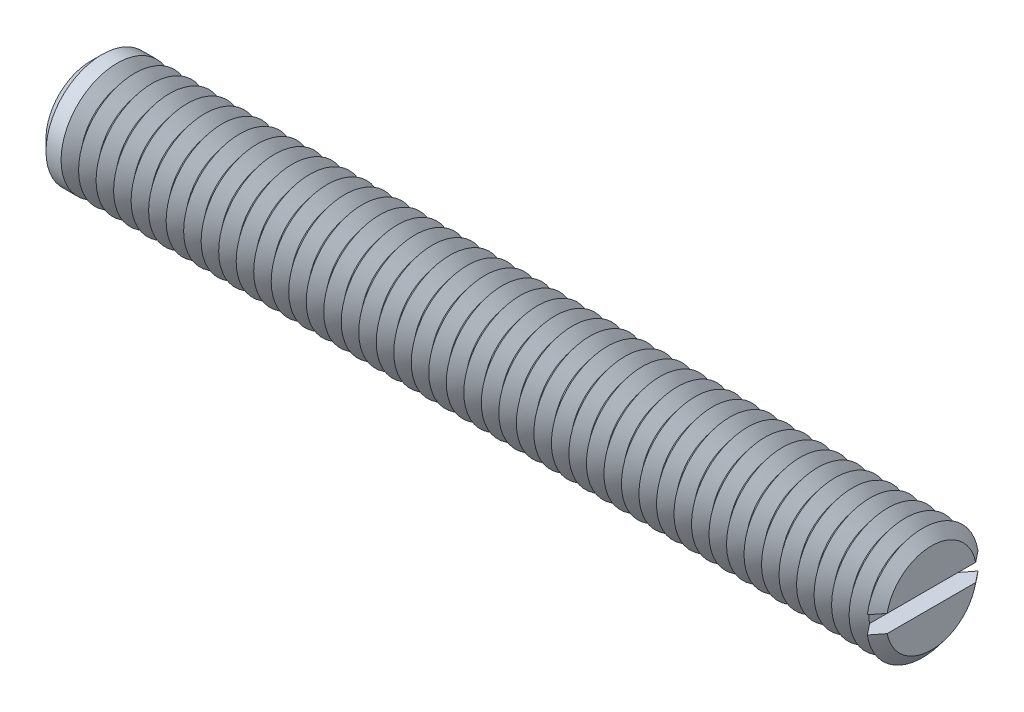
ISO-10303-21;
HEADER;
FILE_DESCRIPTION(('STEP AP214'),'2;1');
FILE_NAME('part.step','',(''),(''),'','','');
FILE_SCHEMA(('AUTOMOTIVE_DESIGN { 1 0 10303 214 1 1 1 1 }'));
ENDSEC;
DATA;
#1=APPLICATION_CONTEXT('core data for automotive mechanical design processes');
#2=APPLICATION_PROTOCOL_DEFINITION('international standard','automotive_design',2000,#1);
#3=PRODUCT_CONTEXT('',#1,'mechanical');
#4=PRODUCT('Part','Part','',(#3));
#5=PRODUCT_RELATED_PRODUCT_CATEGORY('part','',(#4));
#6=PRODUCT_DEFINITION_FORMATION('','',#4);
#7=PRODUCT_DEFINITION_CONTEXT('part definition',#1,'design');
#8=PRODUCT_DEFINITION('design','',#6,#7);
#9=PRODUCT_DEFINITION_SHAPE('','',#8);
#10=(LENGTH_UNIT() NAMED_UNIT(*) SI_UNIT(.MILLI.,.METRE.));
#11=(NAMED_UNIT(*) PLANE_ANGLE_UNIT() SI_UNIT($,.RADIAN.));
#12=(NAMED_UNIT(*) SI_UNIT($,.STERADIAN.) SOLID_ANGLE_UNIT());
#13=UNCERTAINTY_MEASURE_WITH_UNIT(LENGTH_MEASURE(1.E-05),#10,'distance_accuracy_value','');
#14=(GEOMETRIC_REPRESENTATION_CONTEXT(3) GLOBAL_UNCERTAINTY_ASSIGNED_CONTEXT((#13)) GLOBAL_UNIT_ASSIGNED_CONTEXT((#10,
#11,#12)) REPRESENTATION_CONTEXT('',''));
#15=CARTESIAN_POINT('',(0.,0.,0.));
#16=DIRECTION('',(0.,0.,1.));
#17=DIRECTION('',(1.,0.,0.));
#18=AXIS2_PLACEMENT_3D('',#15,#16,#17);
#19=CARTESIAN_POINT('',(29.375,0.,0.));
#20=DIRECTION('',(1.,0.,0.));
#21=DIRECTION('',(0.,0.,-1.));
#22=AXIS2_PLACEMENT_3D('',#19,#20,#21);
#23=CONICAL_SURFACE('',#22,4.,0.895664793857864);
#24=CARTESIAN_POINT('',(29.375,0.,0.));
#25=DIRECTION('',(-1.,0.,0.));
#26=DIRECTION('',(0.,0.,1.));
#27=AXIS2_PLACEMENT_3D('',#24,#25,#26);
#28=CIRCLE('',#27,4.);
#29=CARTESIAN_POINT('',(29.375,-0.624999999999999,-3.95087015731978));
#30=VERTEX_POINT('',#29);
#31=CARTESIAN_POINT('',(29.375,-0.624999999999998,3.95087015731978));
#32=VERTEX_POINT('',#31);
#33=EDGE_CURVE('E117',#30,#32,#28,.T.);
#34=ORIENTED_EDGE('',*,*,#33,.T.);
#35=CARTESIAN_POINT('',(33.1614902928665,-0.624999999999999,-8.70692181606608));
#36=CARTESIAN_POINT('',(32.9148555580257,-0.624999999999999,-8.39807520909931));
#37=CARTESIAN_POINT('',(32.6682552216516,-0.624999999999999,-8.08920109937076));
#38=CARTESIAN_POINT('',(32.17514080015,-0.624999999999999,-7.47132164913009));
#39=CARTESIAN_POINT('',(31.9286267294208,-0.624999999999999,-7.16231629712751));
#40=CARTESIAN_POINT('',(31.4351922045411,-0.624999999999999,-6.54345822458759));
#41=CARTESIAN_POINT('',(31.1882721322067,-0.624999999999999,-6.23360519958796));
#42=CARTESIAN_POINT('',(30.6947157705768,-0.624999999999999,-5.61373487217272));
#43=CARTESIAN_POINT('',(30.4480794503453,-0.624999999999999,-5.30371759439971));
#44=CARTESIAN_POINT('',(30.0704817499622,-0.624999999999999,-4.82841623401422));
#45=CARTESIAN_POINT('',(29.9393680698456,-0.624999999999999,-4.66325315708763));
#46=CARTESIAN_POINT('',(29.6773052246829,-0.624999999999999,-4.33279290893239));
#47=CARTESIAN_POINT('',(29.5463560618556,-0.624999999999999,-4.16749573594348));
#48=CARTESIAN_POINT('',(29.2846416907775,-0.624999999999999,-3.83665276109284));
#49=CARTESIAN_POINT('',(29.1538765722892,-0.624999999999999,-3.67110688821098));
#50=CARTESIAN_POINT('',(28.892697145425,-0.624999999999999,-3.33975147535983));
#51=CARTESIAN_POINT('',(28.7622828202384,-0.624999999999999,-3.17394194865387));
#52=CARTESIAN_POINT('',(28.5022082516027,-0.624999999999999,-2.84217045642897));
#53=CARTESIAN_POINT('',(28.3725471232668,-0.624999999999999,-2.6762091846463));
#54=CARTESIAN_POINT('',(28.1140928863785,-0.624999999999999,-2.34356113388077));
#55=CARTESIAN_POINT('',(27.985299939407,-0.624999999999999,-2.17687422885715));
#56=CARTESIAN_POINT('',(27.7934479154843,-0.624999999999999,-1.92591523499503));
#57=CARTESIAN_POINT('',(27.7297426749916,-0.624999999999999,-1.84213757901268));
#58=CARTESIAN_POINT('',(27.6029724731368,-0.624999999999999,-1.67409978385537));
#59=CARTESIAN_POINT('',(27.5399075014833,-0.624999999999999,-1.58983965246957));
#60=CARTESIAN_POINT('',(27.4147785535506,-0.624999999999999,-1.42061659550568));
#61=CARTESIAN_POINT('',(27.3527142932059,-0.624999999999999,-1.33565388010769));
#62=CARTESIAN_POINT('',(27.2301881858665,-0.624999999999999,-1.16458302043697));
#63=CARTESIAN_POINT('',(27.1697261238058,-0.624999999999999,-1.0784750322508));
#64=CARTESIAN_POINT('',(27.0976838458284,-0.624999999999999,-0.97209256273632));
#65=CARTESIAN_POINT('',(27.0847024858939,-0.624999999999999,-0.952767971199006));
#66=CARTESIAN_POINT('',(27.058912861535,-0.624999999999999,-0.914003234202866));
#67=CARTESIAN_POINT('',(27.0461046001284,-0.624999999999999,-0.894563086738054));
#68=CARTESIAN_POINT('',(27.0079767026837,-0.624999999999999,-0.836043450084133));
#69=CARTESIAN_POINT('',(26.9829560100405,-0.624999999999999,-0.79676778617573));
#70=CARTESIAN_POINT('',(26.9339776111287,-0.624999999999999,-0.717444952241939));
#71=CARTESIAN_POINT('',(26.9100221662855,-0.624999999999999,-0.677396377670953));
#72=CARTESIAN_POINT('',(26.8637207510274,-0.624999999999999,-0.596377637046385));
#73=CARTESIAN_POINT('',(26.8413744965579,-0.624999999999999,-0.555407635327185));
#74=CARTESIAN_POINT('',(26.8059952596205,-0.624999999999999,-0.48581611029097));
#75=CARTESIAN_POINT('',(26.7923049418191,-0.624999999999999,-0.457533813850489));
#76=CARTESIAN_POINT('',(26.766378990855,-0.624999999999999,-0.400313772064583));
#77=CARTESIAN_POINT('',(26.7541438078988,-0.624999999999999,-0.371375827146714));
#78=CARTESIAN_POINT('',(26.7204304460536,-0.624999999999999,-0.283641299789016));
#79=CARTESIAN_POINT('',(26.7017774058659,-0.624999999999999,-0.223617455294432));
#80=CARTESIAN_POINT('',(26.6847644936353,-0.624999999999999,-0.139102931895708));
#81=CARTESIAN_POINT('',(26.68099555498,-0.624999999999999,-0.115688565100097));
#82=CARTESIAN_POINT('',(26.6755004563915,-0.624999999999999,-0.0686260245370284));
#83=CARTESIAN_POINT('',(26.6737732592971,-0.624999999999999,-0.0449779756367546));
#84=CARTESIAN_POINT('',(26.6724835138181,-0.624999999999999,0.00234331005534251));
#85=CARTESIAN_POINT('',(26.672917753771,-0.624999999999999,0.0260164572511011));
#86=CARTESIAN_POINT('',(26.6759063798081,-0.624999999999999,0.0732268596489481));
#87=CARTESIAN_POINT('',(26.6784611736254,-0.624999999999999,0.0967640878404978));
#88=CARTESIAN_POINT('',(26.691400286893,-0.624999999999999,0.182271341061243));
#89=CARTESIAN_POINT('',(26.707744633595,-0.624999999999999,0.243366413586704));
#90=CARTESIAN_POINT('',(26.7388887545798,-0.624999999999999,0.332669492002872));
#91=CARTESIAN_POINT('',(26.7504419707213,-0.624999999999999,0.362174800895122));
#92=CARTESIAN_POINT('',(26.7752210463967,-0.624999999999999,0.420481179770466));
#93=CARTESIAN_POINT('',(26.7884464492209,-0.624999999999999,0.44928243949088));
#94=CARTESIAN_POINT('',(26.8174677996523,-0.624999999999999,0.508972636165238));
#95=CARTESIAN_POINT('',(26.8333885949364,-0.624999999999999,0.539799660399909));
#96=CARTESIAN_POINT('',(26.8663425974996,-0.624999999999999,0.600856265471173));
#97=CARTESIAN_POINT('',(26.8833759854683,-0.624999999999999,0.631085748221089));
#98=CARTESIAN_POINT('',(26.9357348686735,-0.624999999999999,0.721100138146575));
#99=CARTESIAN_POINT('',(26.9722948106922,-0.624999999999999,0.780163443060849));
#100=CARTESIAN_POINT('',(27.0474296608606,-0.624999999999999,0.897183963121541));
#101=CARTESIAN_POINT('',(27.0860094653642,-0.624999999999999,0.955137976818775));
#102=CARTESIAN_POINT('',(27.1644096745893,-0.624999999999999,1.0702065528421));
#103=CARTESIAN_POINT('',(27.2042302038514,-0.624999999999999,1.12732103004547));
#104=CARTESIAN_POINT('',(27.2847841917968,-0.624999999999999,1.24108525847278));
#105=CARTESIAN_POINT('',(27.3255194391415,-0.624999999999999,1.29773373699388));
#106=CARTESIAN_POINT('',(27.4075780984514,-0.624999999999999,1.4106117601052));
#107=CARTESIAN_POINT('',(27.4489015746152,-0.624999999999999,1.46684125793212));
#108=CARTESIAN_POINT('',(27.5733456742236,-0.624999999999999,1.63486189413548));
#109=CARTESIAN_POINT('',(27.6570882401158,-0.624999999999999,1.74619171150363));
#110=CARTESIAN_POINT('',(27.8245788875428,-0.624999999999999,1.96690364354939));
#111=CARTESIAN_POINT('',(27.9083166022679,-0.624999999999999,2.07629366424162));
#112=CARTESIAN_POINT('',(28.0763821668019,-0.624999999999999,2.2946201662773));
#113=CARTESIAN_POINT('',(28.1607100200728,-0.624999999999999,2.40355664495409));
#114=CARTESIAN_POINT('',(28.4142762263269,-0.624999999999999,2.72992534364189));
#115=CARTESIAN_POINT('',(28.5840912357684,-0.624999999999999,2.94690900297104));
#116=CARTESIAN_POINT('',(28.9246141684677,-0.624999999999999,3.38042406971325));
#117=CARTESIAN_POINT('',(29.095322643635,-0.624999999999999,3.59695504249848));
#118=CARTESIAN_POINT('',(29.4371950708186,-0.624999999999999,4.02965109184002));
#119=CARTESIAN_POINT('',(29.6083590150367,-0.624999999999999,4.24581617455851));
#120=CARTESIAN_POINT('',(29.9504500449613,-0.624999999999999,4.67725748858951));
#121=CARTESIAN_POINT('',(30.1213762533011,-0.624999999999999,4.89253441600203));
#122=CARTESIAN_POINT('',(30.4634226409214,-0.624999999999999,5.32293566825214));
#123=CARTESIAN_POINT('',(30.6345428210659,-0.624999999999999,5.53805999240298));
#124=CARTESIAN_POINT('',(31.1480384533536,-0.624999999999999,6.18319284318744));
#125=CARTESIAN_POINT('',(31.4906134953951,-0.624999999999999,6.61304248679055));
#126=CARTESIAN_POINT('',(31.9438892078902,-0.624999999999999,7.18140561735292));
#127=CARTESIAN_POINT('',(32.0544613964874,-0.624999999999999,7.32002163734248));
#128=CARTESIAN_POINT('',(32.2756363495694,-0.624999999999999,7.5972376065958));
#129=CARTESIAN_POINT('',(32.386239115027,-0.624999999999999,7.73583755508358));
#130=CARTESIAN_POINT('',(32.6076076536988,-0.624999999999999,8.01319622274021));
#131=CARTESIAN_POINT('',(32.7183734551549,-0.624999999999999,8.1519549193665));
#132=CARTESIAN_POINT('',(32.9399202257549,-0.624999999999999,8.42945184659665));
#133=CARTESIAN_POINT('',(33.0507011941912,-0.624999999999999,8.56819007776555));
#134=CARTESIAN_POINT('',(33.1614902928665,-0.624999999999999,8.70692181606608));
#135=B_SPLINE_CURVE_WITH_KNOTS('',3,(#35,#36,#37,#38,#39,#40,#41,#42,#43,#44,#45,#46,#47,#48,
#49,#50,#51,#52,#53,#54,#55,#56,#57,#58,#59,#60,#61,#62,#63,#64,#65,#66,#67,#68,#69,#70,#71,#72,
#73,#74,#75,#76,#77,#78,#79,#80,#81,#82,#83,#84,#85,#86,#87,#88,#89,#90,#91,#92,#93,#94,#95,#96,
#97,#98,#99,#100,#101,#102,#103,#104,#105,#106,#107,#108,#109,#110,#111,#112,#113,#114,#115,
#116,#117,#118,#119,#120,#121,#122,#123,#124,#125,#126,#127,#128,#129,#130,#131,#132,#133,#134),
.UNSPECIFIED.,.F.,.F.,(4,2,2,2,2,2,2,2,2,2,2,2,2,2,2,2,2,2,2,2,2,2,2,2,2,2,2,2,2,2,2,2,2,2,2,2,
2,2,2,2,2,2,2,2,2,2,2,2,2,4),(0.,1.1857210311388,2.37158837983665,3.56020338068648,
4.74867342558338,5.38130812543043,6.01395126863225,6.64683693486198,7.27969171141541,
7.9115106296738,8.54344406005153,8.85918511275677,9.17492108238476,9.49056578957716,
9.8061679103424,9.8760068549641,9.94584701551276,10.0855382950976,10.2255132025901,
10.3654633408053,10.4596856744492,10.5539370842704,10.741396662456,10.8124690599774,
10.8835053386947,10.9544360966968,11.0253804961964,11.2137597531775,11.3088096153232,
11.403833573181,11.5078935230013,11.6119704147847,11.8202840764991,12.0291284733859,
12.2379939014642,12.4473111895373,12.6566515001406,13.0745694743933,13.4878513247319,
13.9011356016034,14.7277337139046,15.5549232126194,16.3820986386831,17.2067434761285,
18.0313920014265,19.6803778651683,20.2123228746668,20.7442873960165,21.2769292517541,
21.8095515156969),.UNSPECIFIED.);
#136=CARTESIAN_POINT('',(28.75,-0.624999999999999,3.1581247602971));
#137=VERTEX_POINT('',#136);
#138=EDGE_CURVE('E109',#137,#32,#135,.T.);
#139=ORIENTED_EDGE('',*,*,#138,.F.);
#140=CARTESIAN_POINT('',(28.75,0.,0.));
#141=DIRECTION('',(-1.,0.,0.));
#142=DIRECTION('',(0.,0.,1.));
#143=AXIS2_PLACEMENT_3D('',#140,#141,#142);
#144=CIRCLE('',#143,3.2193752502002);
#145=CARTESIAN_POINT('',(28.75,-0.624999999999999,-3.1581247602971));
#146=VERTEX_POINT('',#145);
#147=EDGE_CURVE('E593',#146,#137,#144,.T.);
#148=ORIENTED_EDGE('',*,*,#147,.F.);
#149=EDGE_CURVE('E58',#30,#146,#135,.T.);
#150=ORIENTED_EDGE('',*,*,#149,.F.);
#151=EDGE_LOOP('',(#34,#139,#148,#150));
#152=FACE_BOUND('',#151,.T.);
#153=ADVANCED_FACE('F37',(#152),#23,.T.);
#154=CARTESIAN_POINT('',(29.375,0.624999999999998,3.95087015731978));
#155=VERTEX_POINT('',#154);
#156=CARTESIAN_POINT('',(29.375,0.624999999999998,-3.95087015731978));
#157=VERTEX_POINT('',#156);
#158=EDGE_CURVE('E100',#155,#157,#28,.T.);
#159=ORIENTED_EDGE('',*,*,#158,.T.);
#160=CARTESIAN_POINT('',(33.1614902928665,0.624999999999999,8.70692181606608));
#161=CARTESIAN_POINT('',(32.9148555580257,0.624999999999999,8.39807520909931));
#162=CARTESIAN_POINT('',(32.6682552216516,0.624999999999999,8.08920109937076));
#163=CARTESIAN_POINT('',(32.17514080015,0.624999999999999,7.47132164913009));
#164=CARTESIAN_POINT('',(31.9286267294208,0.624999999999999,7.16231629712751));
#165=CARTESIAN_POINT('',(31.4351922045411,0.624999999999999,6.54345822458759));
#166=CARTESIAN_POINT('',(31.1882721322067,0.624999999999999,6.23360519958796));
#167=CARTESIAN_POINT('',(30.6947157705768,0.624999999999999,5.61373487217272));
#168=CARTESIAN_POINT('',(30.4480794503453,0.624999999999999,5.30371759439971));
#169=CARTESIAN_POINT('',(30.0704817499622,0.624999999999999,4.82841623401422));
#170=CARTESIAN_POINT('',(29.9393680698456,0.624999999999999,4.66325315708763));
#171=CARTESIAN_POINT('',(29.6773052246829,0.624999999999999,4.33279290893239));
#172=CARTESIAN_POINT('',(29.5463560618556,0.624999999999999,4.16749573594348));
#173=CARTESIAN_POINT('',(29.2846416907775,0.624999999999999,3.83665276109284));
#174=CARTESIAN_POINT('',(29.1538765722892,0.624999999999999,3.67110688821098));
#175=CARTESIAN_POINT('',(28.892697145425,0.624999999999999,3.33975147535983));
#176=CARTESIAN_POINT('',(28.7622828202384,0.624999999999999,3.17394194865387));
#177=CARTESIAN_POINT('',(28.5022082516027,0.624999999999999,2.84217045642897));
#178=CARTESIAN_POINT('',(28.3725471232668,0.624999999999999,2.6762091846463));
#179=CARTESIAN_POINT('',(28.1140928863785,0.624999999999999,2.34356113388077));
#180=CARTESIAN_POINT('',(27.985299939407,0.624999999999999,2.17687422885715));
#181=CARTESIAN_POINT('',(27.7934479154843,0.624999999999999,1.92591523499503));
#182=CARTESIAN_POINT('',(27.7297426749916,0.624999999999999,1.84213757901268));
#183=CARTESIAN_POINT('',(27.6029724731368,0.624999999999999,1.67409978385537));
#184=CARTESIAN_POINT('',(27.5399075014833,0.624999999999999,1.58983965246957));
#185=CARTESIAN_POINT('',(27.4147785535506,0.624999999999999,1.42061659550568));
#186=CARTESIAN_POINT('',(27.3527142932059,0.624999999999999,1.33565388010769));
#187=CARTESIAN_POINT('',(27.2301881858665,0.624999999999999,1.16458302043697));
#188=CARTESIAN_POINT('',(27.1697261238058,0.624999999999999,1.0784750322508));
#189=CARTESIAN_POINT('',(27.0976838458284,0.624999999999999,0.97209256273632));
#190=CARTESIAN_POINT('',(27.0847024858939,0.624999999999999,0.952767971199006));
#191=CARTESIAN_POINT('',(27.058912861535,0.624999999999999,0.914003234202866));
#192=CARTESIAN_POINT('',(27.0461046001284,0.624999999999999,0.894563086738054));
#193=CARTESIAN_POINT('',(27.0079767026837,0.624999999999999,0.836043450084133));
#194=CARTESIAN_POINT('',(26.9829560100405,0.624999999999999,0.79676778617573));
#195=CARTESIAN_POINT('',(26.9339776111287,0.624999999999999,0.717444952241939));
#196=CARTESIAN_POINT('',(26.9100221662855,0.624999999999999,0.677396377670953));
#197=CARTESIAN_POINT('',(26.8637207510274,0.624999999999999,0.596377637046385));
#198=CARTESIAN_POINT('',(26.8413744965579,0.624999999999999,0.555407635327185));
#199=CARTESIAN_POINT('',(26.8059952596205,0.624999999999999,0.48581611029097));
#200=CARTESIAN_POINT('',(26.7923049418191,0.624999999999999,0.457533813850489));
#201=CARTESIAN_POINT('',(26.766378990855,0.624999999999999,0.400313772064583));
#202=CARTESIAN_POINT('',(26.7541438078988,0.624999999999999,0.371375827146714));
#203=CARTESIAN_POINT('',(26.7204304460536,0.624999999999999,0.283641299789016));
#204=CARTESIAN_POINT('',(26.7017774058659,0.624999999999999,0.223617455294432));
#205=CARTESIAN_POINT('',(26.6847644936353,0.624999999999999,0.139102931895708));
#206=CARTESIAN_POINT('',(26.68099555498,0.624999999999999,0.115688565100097));
#207=CARTESIAN_POINT('',(26.6755004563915,0.624999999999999,0.0686260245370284));
#208=CARTESIAN_POINT('',(26.6737732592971,0.624999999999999,0.0449779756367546));
#209=CARTESIAN_POINT('',(26.6724835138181,0.624999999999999,-0.00234331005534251));
#210=CARTESIAN_POINT('',(26.672917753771,0.624999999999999,-0.0260164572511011));
#211=CARTESIAN_POINT('',(26.6759063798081,0.624999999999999,-0.0732268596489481));
#212=CARTESIAN_POINT('',(26.6784611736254,0.624999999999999,-0.0967640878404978));
#213=CARTESIAN_POINT('',(26.691400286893,0.624999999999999,-0.182271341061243));
#214=CARTESIAN_POINT('',(26.707744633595,0.624999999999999,-0.243366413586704));
#215=CARTESIAN_POINT('',(26.7388887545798,0.624999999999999,-0.332669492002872));
#216=CARTESIAN_POINT('',(26.7504419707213,0.624999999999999,-0.362174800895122));
#217=CARTESIAN_POINT('',(26.7752210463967,0.624999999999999,-0.420481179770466));
#218=CARTESIAN_POINT('',(26.7884464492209,0.624999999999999,-0.44928243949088));
#219=CARTESIAN_POINT('',(26.8174677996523,0.624999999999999,-0.508972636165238));
#220=CARTESIAN_POINT('',(26.8333885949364,0.624999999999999,-0.539799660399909));
#221=CARTESIAN_POINT('',(26.8663425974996,0.624999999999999,-0.600856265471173));
#222=CARTESIAN_POINT('',(26.8833759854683,0.624999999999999,-0.631085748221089));
#223=CARTESIAN_POINT('',(26.9357348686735,0.624999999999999,-0.721100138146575));
#224=CARTESIAN_POINT('',(26.9722948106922,0.624999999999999,-0.780163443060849));
#225=CARTESIAN_POINT('',(27.0474296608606,0.624999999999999,-0.897183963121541));
#226=CARTESIAN_POINT('',(27.0860094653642,0.624999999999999,-0.955137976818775));
#227=CARTESIAN_POINT('',(27.1644096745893,0.624999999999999,-1.0702065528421));
#228=CARTESIAN_POINT('',(27.2042302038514,0.624999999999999,-1.12732103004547));
#229=CARTESIAN_POINT('',(27.2847841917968,0.624999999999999,-1.24108525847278));
#230=CARTESIAN_POINT('',(27.3255194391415,0.624999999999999,-1.29773373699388));
#231=CARTESIAN_POINT('',(27.4075780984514,0.624999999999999,-1.4106117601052));
#232=CARTESIAN_POINT('',(27.4489015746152,0.624999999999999,-1.46684125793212));
#233=CARTESIAN_POINT('',(27.5733456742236,0.624999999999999,-1.63486189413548));
#234=CARTESIAN_POINT('',(27.6570882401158,0.624999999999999,-1.74619171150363));
#235=CARTESIAN_POINT('',(27.8245788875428,0.624999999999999,-1.96690364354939));
#236=CARTESIAN_POINT('',(27.9083166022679,0.624999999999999,-2.07629366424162));
#237=CARTESIAN_POINT('',(28.0763821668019,0.624999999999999,-2.2946201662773));
#238=CARTESIAN_POINT('',(28.1607100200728,0.624999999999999,-2.40355664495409));
#239=CARTESIAN_POINT('',(28.4142762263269,0.624999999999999,-2.72992534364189));
#240=CARTESIAN_POINT('',(28.5840912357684,0.624999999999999,-2.94690900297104));
#241=CARTESIAN_POINT('',(28.9246141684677,0.624999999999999,-3.38042406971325));
#242=CARTESIAN_POINT('',(29.095322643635,0.624999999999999,-3.59695504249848));
#243=CARTESIAN_POINT('',(29.4371950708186,0.624999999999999,-4.02965109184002));
#244=CARTESIAN_POINT('',(29.6083590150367,0.624999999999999,-4.24581617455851));
#245=CARTESIAN_POINT('',(29.9504500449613,0.624999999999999,-4.67725748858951));
#246=CARTESIAN_POINT('',(30.1213762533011,0.624999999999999,-4.89253441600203));
#247=CARTESIAN_POINT('',(30.4634226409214,0.624999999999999,-5.32293566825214));
#248=CARTESIAN_POINT('',(30.6345428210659,0.624999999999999,-5.53805999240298));
#249=CARTESIAN_POINT('',(31.1480384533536,0.624999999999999,-6.18319284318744));
#250=CARTESIAN_POINT('',(31.4906134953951,0.624999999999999,-6.61304248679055));
#251=CARTESIAN_POINT('',(31.9438892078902,0.624999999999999,-7.18140561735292));
#252=CARTESIAN_POINT('',(32.0544613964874,0.624999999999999,-7.32002163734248));
#253=CARTESIAN_POINT('',(32.2756363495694,0.624999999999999,-7.5972376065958));
#254=CARTESIAN_POINT('',(32.386239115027,0.624999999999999,-7.73583755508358));
#255=CARTESIAN_POINT('',(32.6076076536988,0.624999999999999,-8.01319622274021));
#256=CARTESIAN_POINT('',(32.7183734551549,0.624999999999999,-8.1519549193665));
#257=CARTESIAN_POINT('',(32.9399202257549,0.624999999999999,-8.42945184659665));
#258=CARTESIAN_POINT('',(33.0507011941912,0.624999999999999,-8.56819007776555));
#259=CARTESIAN_POINT('',(33.1614902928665,0.624999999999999,-8.70692181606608));
#260=B_SPLINE_CURVE_WITH_KNOTS('',3,(#160,#161,#162,#163,#164,#165,#166,#167,#168,#169,#170,
#171,#172,#173,#174,#175,#176,#177,#178,#179,#180,#181,#182,#183,#184,#185,#186,#187,#188,#189,
#190,#191,#192,#193,#194,#195,#196,#197,#198,#199,#200,#201,#202,#203,#204,#205,#206,#207,#208,
#209,#210,#211,#212,#213,#214,#215,#216,#217,#218,#219,#220,#221,#222,#223,#224,#225,#226,#227,
#228,#229,#230,#231,#232,#233,#234,#235,#236,#237,#238,#239,#240,#241,#242,#243,#244,#245,#246,
#247,#248,#249,#250,#251,#252,#253,#254,#255,#256,#257,#258,#259),.UNSPECIFIED.,.F.,.F.,(4,2,2,
2,2,2,2,2,2,2,2,2,2,2,2,2,2,2,2,2,2,2,2,2,2,2,2,2,2,2,2,2,2,2,2,2,2,2,2,2,2,2,2,2,2,2,2,2,2,4),
(0.,1.1857210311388,2.37158837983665,3.56020338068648,4.74867342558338,5.38130812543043,
6.01395126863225,6.64683693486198,7.27969171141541,7.9115106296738,8.54344406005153,
8.85918511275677,9.17492108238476,9.49056578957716,9.8061679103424,9.8760068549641,
9.94584701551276,10.0855382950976,10.2255132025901,10.3654633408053,10.4596856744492,
10.5539370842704,10.741396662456,10.8124690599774,10.8835053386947,10.9544360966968,
11.0253804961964,11.2137597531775,11.3088096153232,11.403833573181,11.5078935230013,
11.6119704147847,11.8202840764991,12.0291284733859,12.2379939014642,12.4473111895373,
12.6566515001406,13.0745694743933,13.4878513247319,13.9011356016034,14.7277337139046,
15.5549232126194,16.3820986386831,17.2067434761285,18.0313920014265,19.6803778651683,
20.2123228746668,20.7442873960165,21.2769292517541,21.8095515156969),.UNSPECIFIED.);
#261=CARTESIAN_POINT('',(28.75,0.624999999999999,-3.1581247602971));
#262=VERTEX_POINT('',#261);
#263=EDGE_CURVE('E110',#262,#157,#260,.T.);
#264=ORIENTED_EDGE('',*,*,#263,.F.);
#265=CARTESIAN_POINT('',(28.75,0.624999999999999,3.1581247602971));
#266=VERTEX_POINT('',#265);
#267=EDGE_CURVE('E103',#266,#262,#144,.T.);
#268=ORIENTED_EDGE('',*,*,#267,.F.);
#269=EDGE_CURVE('E97',#155,#266,#260,.T.);
#270=ORIENTED_EDGE('',*,*,#269,.F.);
#271=EDGE_LOOP('',(#159,#264,#268,#270));
#272=FACE_BOUND('',#271,.T.);
#273=ADVANCED_FACE('F99',(#272),#23,.T.);
#274=CARTESIAN_POINT('',(28.75,0.,0.));
#275=DIRECTION('',(-1.,0.,0.));
#276=DIRECTION('',(0.,0.,1.));
#277=AXIS2_PLACEMENT_3D('',#274,#275,#276);
#278=CONICAL_SURFACE('',#277,3.2193752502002,0.895664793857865);
#279=CARTESIAN_POINT('',(28.125,0.,0.));
#280=DIRECTION('',(-1.,0.,0.));
#281=DIRECTION('',(0.,0.,1.));
#282=AXIS2_PLACEMENT_3D('',#279,#280,#281);
#283=CIRCLE('',#282,4.);
#284=CARTESIAN_POINT('',(28.125,0.,4.));
#285=VERTEX_POINT('',#284);
#286=EDGE_CURVE('E578',#285,#285,#283,.T.);
#287=ORIENTED_EDGE('',*,*,#286,.F.);
#288=EDGE_LOOP('',(#287));
#289=FACE_BOUND('',#288,.T.);
#290=ORIENTED_EDGE('',*,*,#267,.T.);
#291=EDGE_CURVE('E587',#262,#146,#144,.T.);
#292=ORIENTED_EDGE('',*,*,#291,.T.);
#293=ORIENTED_EDGE('',*,*,#147,.T.);
#294=EDGE_CURVE('E585',#137,#266,#144,.T.);
#295=ORIENTED_EDGE('',*,*,#294,.T.);
#296=EDGE_LOOP('',(#290,#292,#293,#295));
#297=FACE_BOUND('',#296,.T.);
#298=ADVANCED_FACE('F168',(#289,#297),#278,.T.);
#299=CARTESIAN_POINT('',(30.,0.,0.));
#300=DIRECTION('',(1.,0.,0.));
#301=DIRECTION('',(0.,0.,-1.));
#302=AXIS2_PLACEMENT_3D('',#299,#300,#301);
#303=PLANE('',#302);
#304=CARTESIAN_POINT('',(30.,0.,0.));
#305=DIRECTION('',(-1.,0.,0.));
#306=DIRECTION('',(0.,0.,1.));
#307=AXIS2_PLACEMENT_3D('',#304,#305,#306);
#308=CIRCLE('',#307,3.2193752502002);
#309=CARTESIAN_POINT('',(30.,0.624999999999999,3.1581247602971));
#310=VERTEX_POINT('',#309);
#311=CARTESIAN_POINT('',(30.,0.624999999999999,-3.1581247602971));
#312=VERTEX_POINT('',#311);
#313=EDGE_CURVE('E160',#310,#312,#308,.T.);
#314=ORIENTED_EDGE('',*,*,#313,.F.);
#315=DIRECTION('',(0.,0.,1.));
#316=VECTOR('',#315,1.);
#317=CARTESIAN_POINT('',(30.,0.624999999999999,0.));
#318=LINE('',#317,#316);
#319=EDGE_CURVE('E122',#312,#310,#318,.T.);
#320=ORIENTED_EDGE('',*,*,#319,.F.);
#321=EDGE_LOOP('',(#314,#320));
#322=FACE_BOUND('',#321,.T.);
#323=ADVANCED_FACE('F172',(#322),#303,.T.);
#324=CARTESIAN_POINT('',(30.,-0.624999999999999,-3.1581247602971));
#325=VERTEX_POINT('',#324);
#326=CARTESIAN_POINT('',(30.,-0.624999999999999,3.1581247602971));
#327=VERTEX_POINT('',#326);
#328=EDGE_CURVE('E66',#325,#327,#308,.T.);
#329=ORIENTED_EDGE('',*,*,#328,.F.);
#330=DIRECTION('',(0.,0.,-1.));
#331=VECTOR('',#330,1.);
#332=CARTESIAN_POINT('',(30.,-0.624999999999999,0.));
#333=LINE('',#332,#331);
#334=EDGE_CURVE('E136',#327,#325,#333,.T.);
#335=ORIENTED_EDGE('',*,*,#334,.F.);
#336=EDGE_LOOP('',(#329,#335));
#337=FACE_BOUND('',#336,.T.);
#338=ADVANCED_FACE('F203',(#337),#303,.T.);
#339=CARTESIAN_POINT('',(30.,0.,0.));
#340=DIRECTION('',(-1.,0.,0.));
#341=DIRECTION('',(0.,0.,1.));
#342=AXIS2_PLACEMENT_3D('',#339,#340,#341);
#343=CONICAL_SURFACE('',#342,3.2193752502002,0.895664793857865);
#344=ORIENTED_EDGE('',*,*,#158,.F.);
#345=CARTESIAN_POINT('',(25.5885097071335,0.624999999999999,-8.70692181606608));
#346=CARTESIAN_POINT('',(25.8351444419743,0.624999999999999,-8.39807520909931));
#347=CARTESIAN_POINT('',(26.0817447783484,0.624999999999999,-8.08920109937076));
#348=CARTESIAN_POINT('',(26.5748591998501,0.624999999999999,-7.47132164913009));
#349=CARTESIAN_POINT('',(26.8213732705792,0.624999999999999,-7.16231629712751));
#350=CARTESIAN_POINT('',(27.3148077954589,0.624999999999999,-6.54345822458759));
#351=CARTESIAN_POINT('',(27.5617278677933,0.624999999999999,-6.23360519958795));
#352=CARTESIAN_POINT('',(28.0552842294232,0.624999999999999,-5.61373487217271));
#353=CARTESIAN_POINT('',(28.3019205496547,0.624999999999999,-5.3037175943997));
#354=CARTESIAN_POINT('',(28.6795182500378,0.624999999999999,-4.82841623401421));
#355=CARTESIAN_POINT('',(28.8106319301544,0.624999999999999,-4.66325315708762));
#356=CARTESIAN_POINT('',(29.0726947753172,0.624999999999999,-4.33279290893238));
#357=CARTESIAN_POINT('',(29.2036439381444,0.624999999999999,-4.16749573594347));
#358=CARTESIAN_POINT('',(29.4653583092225,0.624999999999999,-3.83665276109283));
#359=CARTESIAN_POINT('',(29.5961234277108,0.624999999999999,-3.67110688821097));
#360=CARTESIAN_POINT('',(29.857302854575,0.624999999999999,-3.33975147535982));
#361=CARTESIAN_POINT('',(29.9877171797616,0.624999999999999,-3.17394194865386));
#362=CARTESIAN_POINT('',(30.2477917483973,0.624999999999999,-2.84217045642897));
#363=CARTESIAN_POINT('',(30.3774528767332,0.624999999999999,-2.6762091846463));
#364=CARTESIAN_POINT('',(30.6359071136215,0.624999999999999,-2.34356113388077));
#365=CARTESIAN_POINT('',(30.764700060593,0.624999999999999,-2.17687422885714));
#366=CARTESIAN_POINT('',(30.9565520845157,0.624999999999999,-1.92591523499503));
#367=CARTESIAN_POINT('',(31.0202573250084,0.624999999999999,-1.84213757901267));
#368=CARTESIAN_POINT('',(31.1470275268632,0.624999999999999,-1.67409978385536));
#369=CARTESIAN_POINT('',(31.2100924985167,0.624999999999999,-1.58983965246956));
#370=CARTESIAN_POINT('',(31.3352214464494,0.624999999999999,-1.42061659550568));
#371=CARTESIAN_POINT('',(31.3972857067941,0.624999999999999,-1.33565388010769));
#372=CARTESIAN_POINT('',(31.5198118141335,0.624999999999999,-1.16458302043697));
#373=CARTESIAN_POINT('',(31.5802738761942,0.624999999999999,-1.0784750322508));
#374=CARTESIAN_POINT('',(31.6523161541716,0.624999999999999,-0.972092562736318));
#375=CARTESIAN_POINT('',(31.6652975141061,0.624999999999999,-0.952767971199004));
#376=CARTESIAN_POINT('',(31.6910871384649,0.624999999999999,-0.914003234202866));
#377=CARTESIAN_POINT('',(31.7038953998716,0.624999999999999,-0.894563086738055));
#378=CARTESIAN_POINT('',(31.7420232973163,0.624999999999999,-0.836043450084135));
#379=CARTESIAN_POINT('',(31.7670439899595,0.624999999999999,-0.79676778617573));
#380=CARTESIAN_POINT('',(31.8160223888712,0.624999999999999,-0.717444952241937));
#381=CARTESIAN_POINT('',(31.8399778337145,0.624999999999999,-0.677396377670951));
#382=CARTESIAN_POINT('',(31.8862792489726,0.624999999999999,-0.596377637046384));
#383=CARTESIAN_POINT('',(31.9086255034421,0.624999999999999,-0.555407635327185));
#384=CARTESIAN_POINT('',(31.9440047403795,0.624999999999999,-0.485816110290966));
#385=CARTESIAN_POINT('',(31.9576950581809,0.624999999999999,-0.457533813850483));
#386=CARTESIAN_POINT('',(31.983621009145,0.624999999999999,-0.400313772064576));
#387=CARTESIAN_POINT('',(31.9958561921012,0.624999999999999,-0.371375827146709));
#388=CARTESIAN_POINT('',(32.0295695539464,0.624999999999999,-0.283641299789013));
#389=CARTESIAN_POINT('',(32.0482225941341,0.624999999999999,-0.22361745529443));
#390=CARTESIAN_POINT('',(32.0652355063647,0.624999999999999,-0.139102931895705));
#391=CARTESIAN_POINT('',(32.06900444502,0.624999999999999,-0.115688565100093));
#392=CARTESIAN_POINT('',(32.0744995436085,0.624999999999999,-0.0686260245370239));
#393=CARTESIAN_POINT('',(32.0762267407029,0.624999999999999,-0.0449779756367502));
#394=CARTESIAN_POINT('',(32.0775164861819,0.624999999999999,0.00234331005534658));
#395=CARTESIAN_POINT('',(32.0770822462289,0.624999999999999,0.026016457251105));
#396=CARTESIAN_POINT('',(32.0740936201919,0.624999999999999,0.0732268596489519));
#397=CARTESIAN_POINT('',(32.0715388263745,0.624999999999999,0.0967640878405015));
#398=CARTESIAN_POINT('',(32.058599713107,0.624999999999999,0.182271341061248));
#399=CARTESIAN_POINT('',(32.0422553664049,0.624999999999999,0.243366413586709));
#400=CARTESIAN_POINT('',(32.0111112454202,0.624999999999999,0.332669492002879));
#401=CARTESIAN_POINT('',(31.9995580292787,0.624999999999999,0.362174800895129));
#402=CARTESIAN_POINT('',(31.9747789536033,0.624999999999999,0.420481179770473));
#403=CARTESIAN_POINT('',(31.9615535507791,0.624999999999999,0.449282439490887));
#404=CARTESIAN_POINT('',(31.9325322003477,0.624999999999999,0.508972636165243));
#405=CARTESIAN_POINT('',(31.9166114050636,0.624999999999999,0.539799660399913));
#406=CARTESIAN_POINT('',(31.8836574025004,0.624999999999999,0.600856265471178));
#407=CARTESIAN_POINT('',(31.8666240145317,0.624999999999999,0.631085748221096));
#408=CARTESIAN_POINT('',(31.8142651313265,0.624999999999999,0.721100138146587));
#409=CARTESIAN_POINT('',(31.7777051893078,0.624999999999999,0.780163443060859));
#410=CARTESIAN_POINT('',(31.7025703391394,0.624999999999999,0.897183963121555));
#411=CARTESIAN_POINT('',(31.6639905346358,0.624999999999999,0.955137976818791));
#412=CARTESIAN_POINT('',(31.5855903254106,0.624999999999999,1.07020655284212));
#413=CARTESIAN_POINT('',(31.5457697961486,0.624999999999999,1.12732103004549));
#414=CARTESIAN_POINT('',(31.4652158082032,0.624999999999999,1.2410852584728));
#415=CARTESIAN_POINT('',(31.4244805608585,0.624999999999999,1.2977337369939));
#416=CARTESIAN_POINT('',(31.3424219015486,0.624999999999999,1.41061176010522));
#417=CARTESIAN_POINT('',(31.3010984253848,0.624999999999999,1.46684125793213));
#418=CARTESIAN_POINT('',(31.1766543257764,0.624999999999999,1.6348618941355));
#419=CARTESIAN_POINT('',(31.0929117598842,0.624999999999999,1.74619171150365));
#420=CARTESIAN_POINT('',(30.9254211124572,0.624999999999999,1.96690364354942));
#421=CARTESIAN_POINT('',(30.8416833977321,0.624999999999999,2.07629366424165));
#422=CARTESIAN_POINT('',(30.6736178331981,0.624999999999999,2.29462016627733));
#423=CARTESIAN_POINT('',(30.5892899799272,0.624999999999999,2.40355664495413));
#424=CARTESIAN_POINT('',(30.3357237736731,0.624999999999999,2.72992534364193));
#425=CARTESIAN_POINT('',(30.1659087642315,0.624999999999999,2.94690900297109));
#426=CARTESIAN_POINT('',(29.8253858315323,0.624999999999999,3.38042406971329));
#427=CARTESIAN_POINT('',(29.6546773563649,0.624999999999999,3.59695504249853));
#428=CARTESIAN_POINT('',(29.3128049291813,0.624999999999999,4.02965109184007));
#429=CARTESIAN_POINT('',(29.1416409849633,0.624999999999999,4.24581617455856));
#430=CARTESIAN_POINT('',(28.7995499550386,0.624999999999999,4.67725748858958));
#431=CARTESIAN_POINT('',(28.6286237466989,0.624999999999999,4.89253441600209));
#432=CARTESIAN_POINT('',(28.2865773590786,0.624999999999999,5.32293566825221));
#433=CARTESIAN_POINT('',(28.115457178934,0.624999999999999,5.53805999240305));
#434=CARTESIAN_POINT('',(27.6019615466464,0.624999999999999,6.18319284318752));
#435=CARTESIAN_POINT('',(27.2593865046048,0.624999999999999,6.61304248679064));
#436=CARTESIAN_POINT('',(26.8061107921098,0.624999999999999,7.18140561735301));
#437=CARTESIAN_POINT('',(26.6955386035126,0.624999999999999,7.32002163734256));
#438=CARTESIAN_POINT('',(26.4743636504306,0.624999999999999,7.59723760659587));
#439=CARTESIAN_POINT('',(26.363760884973,0.624999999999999,7.73583755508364));
#440=CARTESIAN_POINT('',(26.1423923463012,0.624999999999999,8.01319622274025));
#441=CARTESIAN_POINT('',(26.0316265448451,0.624999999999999,8.15195491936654));
#442=CARTESIAN_POINT('',(25.810079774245,0.624999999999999,8.42945184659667));
#443=CARTESIAN_POINT('',(25.6992988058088,0.624999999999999,8.56819007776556));
#444=CARTESIAN_POINT('',(25.5885097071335,0.624999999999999,8.70692181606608));
#445=B_SPLINE_CURVE_WITH_KNOTS('',3,(#345,#346,#347,#348,#349,#350,#351,#352,#353,#354,#355,
#356,#357,#358,#359,#360,#361,#362,#363,#364,#365,#366,#367,#368,#369,#370,#371,#372,#373,#374,
#375,#376,#377,#378,#379,#380,#381,#382,#383,#384,#385,#386,#387,#388,#389,#390,#391,#392,#393,
#394,#395,#396,#397,#398,#399,#400,#401,#402,#403,#404,#405,#406,#407,#408,#409,#410,#411,#412,
#413,#414,#415,#416,#417,#418,#419,#420,#421,#422,#423,#424,#425,#426,#427,#428,#429,#430,#431,
#432,#433,#434,#435,#436,#437,#438,#439,#440,#441,#442,#443,#444),.UNSPECIFIED.,.F.,.F.,(4,2,2,
2,2,2,2,2,2,2,2,2,2,2,2,2,2,2,2,2,2,2,2,2,2,2,2,2,2,2,2,2,2,2,2,2,2,2,2,2,2,2,2,2,2,2,2,2,2,4),
(0.,1.18572103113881,2.37158837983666,3.56020338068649,4.74867342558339,5.38130812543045,
6.01395126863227,6.646836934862,7.27969171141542,7.91151062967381,8.54344406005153,
8.85918511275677,9.17492108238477,9.49056578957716,9.8061679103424,9.8760068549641,
9.94584701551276,10.0855382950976,10.2255132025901,10.3654633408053,10.4596856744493,
10.5539370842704,10.741396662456,10.8124690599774,10.8835053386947,10.9544360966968,
11.0253804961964,11.2137597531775,11.3088096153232,11.403833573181,11.5078935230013,
11.6119704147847,11.8202840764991,12.0291284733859,12.2379939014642,12.4473111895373,
12.6566515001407,13.0745694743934,13.487851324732,13.9011356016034,14.7277337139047,
15.5549232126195,16.3820986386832,17.2067434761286,18.0313920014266,19.6803778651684,
20.2123228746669,20.7442873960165,21.2769292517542,21.8095515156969),.UNSPECIFIED.);
#446=EDGE_CURVE('E41',#310,#155,#445,.T.);
#447=ORIENTED_EDGE('',*,*,#446,.F.);
#448=ORIENTED_EDGE('',*,*,#313,.T.);
#449=EDGE_CURVE('E11',#157,#312,#445,.T.);
#450=ORIENTED_EDGE('',*,*,#449,.F.);
#451=EDGE_LOOP('',(#344,#447,#448,#450));
#452=FACE_BOUND('',#451,.T.);
#453=ADVANCED_FACE('F114',(#452),#343,.T.);
#454=CARTESIAN_POINT('',(30.,0.624999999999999,-6.));
#455=DIRECTION('',(0.,1.,0.));
#456=DIRECTION('',(0.,0.,1.));
#457=AXIS2_PLACEMENT_3D('',#454,#455,#456);
#458=PLANE('',#457);
#459=ORIENTED_EDGE('',*,*,#446,.T.);
#460=ORIENTED_EDGE('',*,*,#269,.T.);
#461=DIRECTION('',(0.,0.,1.));
#462=VECTOR('',#461,1.);
#463=CARTESIAN_POINT('',(28.75,0.624999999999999,-6.));
#464=LINE('',#463,#462);
#465=EDGE_CURVE('E145',#262,#266,#464,.T.);
#466=ORIENTED_EDGE('',*,*,#465,.F.);
#467=ORIENTED_EDGE('',*,*,#263,.T.);
#468=ORIENTED_EDGE('',*,*,#449,.T.);
#469=ORIENTED_EDGE('',*,*,#319,.T.);
#470=EDGE_LOOP('',(#459,#460,#466,#467,#468,#469));
#471=FACE_BOUND('',#470,.T.);
#472=ADVANCED_FACE('F120',(#471),#458,.F.);
#473=ORIENTED_EDGE('',*,*,#33,.F.);
#474=CARTESIAN_POINT('',(25.5885097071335,-0.624999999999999,8.70692181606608));
#475=CARTESIAN_POINT('',(25.8351444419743,-0.624999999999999,8.39807520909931));
#476=CARTESIAN_POINT('',(26.0817447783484,-0.624999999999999,8.08920109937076));
#477=CARTESIAN_POINT('',(26.5748591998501,-0.624999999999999,7.47132164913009));
#478=CARTESIAN_POINT('',(26.8213732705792,-0.624999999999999,7.16231629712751));
#479=CARTESIAN_POINT('',(27.3148077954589,-0.624999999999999,6.54345822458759));
#480=CARTESIAN_POINT('',(27.5617278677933,-0.624999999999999,6.23360519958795));
#481=CARTESIAN_POINT('',(28.0552842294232,-0.624999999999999,5.61373487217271));
#482=CARTESIAN_POINT('',(28.3019205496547,-0.624999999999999,5.3037175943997));
#483=CARTESIAN_POINT('',(28.6795182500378,-0.624999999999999,4.82841623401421));
#484=CARTESIAN_POINT('',(28.8106319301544,-0.624999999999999,4.66325315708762));
#485=CARTESIAN_POINT('',(29.0726947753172,-0.624999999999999,4.33279290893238));
#486=CARTESIAN_POINT('',(29.2036439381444,-0.624999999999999,4.16749573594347));
#487=CARTESIAN_POINT('',(29.4653583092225,-0.624999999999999,3.83665276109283));
#488=CARTESIAN_POINT('',(29.5961234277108,-0.624999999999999,3.67110688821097));
#489=CARTESIAN_POINT('',(29.857302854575,-0.624999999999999,3.33975147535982));
#490=CARTESIAN_POINT('',(29.9877171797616,-0.624999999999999,3.17394194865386));
#491=CARTESIAN_POINT('',(30.2477917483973,-0.624999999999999,2.84217045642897));
#492=CARTESIAN_POINT('',(30.3774528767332,-0.624999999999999,2.6762091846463));
#493=CARTESIAN_POINT('',(30.6359071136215,-0.624999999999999,2.34356113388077));
#494=CARTESIAN_POINT('',(30.764700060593,-0.624999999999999,2.17687422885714));
#495=CARTESIAN_POINT('',(30.9565520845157,-0.624999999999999,1.92591523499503));
#496=CARTESIAN_POINT('',(31.0202573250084,-0.624999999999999,1.84213757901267));
#497=CARTESIAN_POINT('',(31.1470275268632,-0.624999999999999,1.67409978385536));
#498=CARTESIAN_POINT('',(31.2100924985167,-0.624999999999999,1.58983965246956));
#499=CARTESIAN_POINT('',(31.3352214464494,-0.624999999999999,1.42061659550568));
#500=CARTESIAN_POINT('',(31.3972857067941,-0.624999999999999,1.33565388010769));
#501=CARTESIAN_POINT('',(31.5198118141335,-0.624999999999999,1.16458302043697));
#502=CARTESIAN_POINT('',(31.5802738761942,-0.624999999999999,1.0784750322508));
#503=CARTESIAN_POINT('',(31.6523161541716,-0.624999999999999,0.972092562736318));
#504=CARTESIAN_POINT('',(31.6652975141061,-0.624999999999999,0.952767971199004));
#505=CARTESIAN_POINT('',(31.6910871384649,-0.624999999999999,0.914003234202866));
#506=CARTESIAN_POINT('',(31.7038953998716,-0.624999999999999,0.894563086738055));
#507=CARTESIAN_POINT('',(31.7420232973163,-0.624999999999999,0.836043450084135));
#508=CARTESIAN_POINT('',(31.7670439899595,-0.624999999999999,0.79676778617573));
#509=CARTESIAN_POINT('',(31.8160223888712,-0.624999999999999,0.717444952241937));
#510=CARTESIAN_POINT('',(31.8399778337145,-0.624999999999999,0.677396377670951));
#511=CARTESIAN_POINT('',(31.8862792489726,-0.624999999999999,0.596377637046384));
#512=CARTESIAN_POINT('',(31.9086255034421,-0.624999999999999,0.555407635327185));
#513=CARTESIAN_POINT('',(31.9440047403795,-0.624999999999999,0.485816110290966));
#514=CARTESIAN_POINT('',(31.9576950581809,-0.624999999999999,0.457533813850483));
#515=CARTESIAN_POINT('',(31.983621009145,-0.624999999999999,0.400313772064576));
#516=CARTESIAN_POINT('',(31.9958561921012,-0.624999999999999,0.371375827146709));
#517=CARTESIAN_POINT('',(32.0295695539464,-0.624999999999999,0.283641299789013));
#518=CARTESIAN_POINT('',(32.0482225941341,-0.624999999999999,0.22361745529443));
#519=CARTESIAN_POINT('',(32.0652355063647,-0.624999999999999,0.139102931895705));
#520=CARTESIAN_POINT('',(32.06900444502,-0.624999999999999,0.115688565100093));
#521=CARTESIAN_POINT('',(32.0744995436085,-0.624999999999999,0.0686260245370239));
#522=CARTESIAN_POINT('',(32.0762267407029,-0.624999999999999,0.0449779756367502));
#523=CARTESIAN_POINT('',(32.0775164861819,-0.624999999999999,-0.00234331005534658));
#524=CARTESIAN_POINT('',(32.0770822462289,-0.624999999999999,-0.026016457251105));
#525=CARTESIAN_POINT('',(32.0740936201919,-0.624999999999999,-0.0732268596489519));
#526=CARTESIAN_POINT('',(32.0715388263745,-0.624999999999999,-0.0967640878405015));
#527=CARTESIAN_POINT('',(32.058599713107,-0.624999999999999,-0.182271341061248));
#528=CARTESIAN_POINT('',(32.0422553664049,-0.624999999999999,-0.243366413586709));
#529=CARTESIAN_POINT('',(32.0111112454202,-0.624999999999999,-0.332669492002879));
#530=CARTESIAN_POINT('',(31.9995580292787,-0.624999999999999,-0.362174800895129));
#531=CARTESIAN_POINT('',(31.9747789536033,-0.624999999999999,-0.420481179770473));
#532=CARTESIAN_POINT('',(31.9615535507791,-0.624999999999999,-0.449282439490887));
#533=CARTESIAN_POINT('',(31.9325322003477,-0.624999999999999,-0.508972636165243));
#534=CARTESIAN_POINT('',(31.9166114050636,-0.624999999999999,-0.539799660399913));
#535=CARTESIAN_POINT('',(31.8836574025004,-0.624999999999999,-0.600856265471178));
#536=CARTESIAN_POINT('',(31.8666240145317,-0.624999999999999,-0.631085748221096));
#537=CARTESIAN_POINT('',(31.8142651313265,-0.624999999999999,-0.721100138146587));
#538=CARTESIAN_POINT('',(31.7777051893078,-0.624999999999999,-0.780163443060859));
#539=CARTESIAN_POINT('',(31.7025703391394,-0.624999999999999,-0.897183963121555));
#540=CARTESIAN_POINT('',(31.6639905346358,-0.624999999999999,-0.955137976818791));
#541=CARTESIAN_POINT('',(31.5855903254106,-0.624999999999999,-1.07020655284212));
#542=CARTESIAN_POINT('',(31.5457697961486,-0.624999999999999,-1.12732103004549));
#543=CARTESIAN_POINT('',(31.4652158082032,-0.624999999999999,-1.2410852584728));
#544=CARTESIAN_POINT('',(31.4244805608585,-0.624999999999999,-1.2977337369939));
#545=CARTESIAN_POINT('',(31.3424219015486,-0.624999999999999,-1.41061176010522));
#546=CARTESIAN_POINT('',(31.3010984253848,-0.624999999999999,-1.46684125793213));
#547=CARTESIAN_POINT('',(31.1766543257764,-0.624999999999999,-1.6348618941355));
#548=CARTESIAN_POINT('',(31.0929117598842,-0.624999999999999,-1.74619171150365));
#549=CARTESIAN_POINT('',(30.9254211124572,-0.624999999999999,-1.96690364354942));
#550=CARTESIAN_POINT('',(30.8416833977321,-0.624999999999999,-2.07629366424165));
#551=CARTESIAN_POINT('',(30.6736178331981,-0.624999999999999,-2.29462016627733));
#552=CARTESIAN_POINT('',(30.5892899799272,-0.624999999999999,-2.40355664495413));
#553=CARTESIAN_POINT('',(30.3357237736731,-0.624999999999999,-2.72992534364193));
#554=CARTESIAN_POINT('',(30.1659087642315,-0.624999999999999,-2.94690900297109));
#555=CARTESIAN_POINT('',(29.8253858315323,-0.624999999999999,-3.38042406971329));
#556=CARTESIAN_POINT('',(29.6546773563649,-0.624999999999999,-3.59695504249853));
#557=CARTESIAN_POINT('',(29.3128049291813,-0.624999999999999,-4.02965109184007));
#558=CARTESIAN_POINT('',(29.1416409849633,-0.624999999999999,-4.24581617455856));
#559=CARTESIAN_POINT('',(28.7995499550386,-0.624999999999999,-4.67725748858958));
#560=CARTESIAN_POINT('',(28.6286237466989,-0.624999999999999,-4.89253441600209));
#561=CARTESIAN_POINT('',(28.2865773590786,-0.624999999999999,-5.32293566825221));
#562=CARTESIAN_POINT('',(28.115457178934,-0.624999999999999,-5.53805999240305));
#563=CARTESIAN_POINT('',(27.6019615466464,-0.624999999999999,-6.18319284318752));
#564=CARTESIAN_POINT('',(27.2593865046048,-0.624999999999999,-6.61304248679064));
#565=CARTESIAN_POINT('',(26.8061107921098,-0.624999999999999,-7.18140561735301));
#566=CARTESIAN_POINT('',(26.6955386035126,-0.624999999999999,-7.32002163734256));
#567=CARTESIAN_POINT('',(26.4743636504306,-0.624999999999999,-7.59723760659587));
#568=CARTESIAN_POINT('',(26.363760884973,-0.624999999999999,-7.73583755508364));
#569=CARTESIAN_POINT('',(26.1423923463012,-0.624999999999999,-8.01319622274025));
#570=CARTESIAN_POINT('',(26.0316265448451,-0.624999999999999,-8.15195491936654));
#571=CARTESIAN_POINT('',(25.810079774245,-0.624999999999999,-8.42945184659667));
#572=CARTESIAN_POINT('',(25.6992988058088,-0.624999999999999,-8.56819007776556));
#573=CARTESIAN_POINT('',(25.5885097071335,-0.624999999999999,-8.70692181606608));
#574=B_SPLINE_CURVE_WITH_KNOTS('',3,(#474,#475,#476,#477,#478,#479,#480,#481,#482,#483,#484,
#485,#486,#487,#488,#489,#490,#491,#492,#493,#494,#495,#496,#497,#498,#499,#500,#501,#502,#503,
#504,#505,#506,#507,#508,#509,#510,#511,#512,#513,#514,#515,#516,#517,#518,#519,#520,#521,#522,
#523,#524,#525,#526,#527,#528,#529,#530,#531,#532,#533,#534,#535,#536,#537,#538,#539,#540,#541,
#542,#543,#544,#545,#546,#547,#548,#549,#550,#551,#552,#553,#554,#555,#556,#557,#558,#559,#560,
#561,#562,#563,#564,#565,#566,#567,#568,#569,#570,#571,#572,#573),.UNSPECIFIED.,.F.,.F.,(4,2,2,
2,2,2,2,2,2,2,2,2,2,2,2,2,2,2,2,2,2,2,2,2,2,2,2,2,2,2,2,2,2,2,2,2,2,2,2,2,2,2,2,2,2,2,2,2,2,4),
(0.,1.18572103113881,2.37158837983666,3.56020338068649,4.74867342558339,5.38130812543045,
6.01395126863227,6.646836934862,7.27969171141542,7.91151062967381,8.54344406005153,
8.85918511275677,9.17492108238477,9.49056578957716,9.8061679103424,9.8760068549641,
9.94584701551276,10.0855382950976,10.2255132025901,10.3654633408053,10.4596856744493,
10.5539370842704,10.741396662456,10.8124690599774,10.8835053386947,10.9544360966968,
11.0253804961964,11.2137597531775,11.3088096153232,11.403833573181,11.5078935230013,
11.6119704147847,11.8202840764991,12.0291284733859,12.2379939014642,12.4473111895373,
12.6566515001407,13.0745694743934,13.487851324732,13.9011356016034,14.7277337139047,
15.5549232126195,16.3820986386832,17.2067434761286,18.0313920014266,19.6803778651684,
20.2123228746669,20.7442873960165,21.2769292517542,21.8095515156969),.UNSPECIFIED.);
#575=EDGE_CURVE('E152',#325,#30,#574,.T.);
#576=ORIENTED_EDGE('',*,*,#575,.F.);
#577=ORIENTED_EDGE('',*,*,#328,.T.);
#578=EDGE_CURVE('E148',#32,#327,#574,.T.);
#579=ORIENTED_EDGE('',*,*,#578,.F.);
#580=EDGE_LOOP('',(#473,#576,#577,#579));
#581=FACE_BOUND('',#580,.T.);
#582=ADVANCED_FACE('F164',(#581),#343,.T.);
#583=CARTESIAN_POINT('',(30.,-0.624999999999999,-6.));
#584=DIRECTION('',(0.,-1.,0.));
#585=DIRECTION('',(0.,0.,-1.));
#586=AXIS2_PLACEMENT_3D('',#583,#584,#585);
#587=PLANE('',#586);
#588=ORIENTED_EDGE('',*,*,#575,.T.);
#589=ORIENTED_EDGE('',*,*,#149,.T.);
#590=DIRECTION('',(0.,0.,1.));
#591=VECTOR('',#590,1.);
#592=CARTESIAN_POINT('',(28.75,-0.624999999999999,-6.));
#593=LINE('',#592,#591);
#594=EDGE_CURVE('E144',#146,#137,#593,.T.);
#595=ORIENTED_EDGE('',*,*,#594,.T.);
#596=ORIENTED_EDGE('',*,*,#138,.T.);
#597=ORIENTED_EDGE('',*,*,#578,.T.);
#598=ORIENTED_EDGE('',*,*,#334,.T.);
#599=EDGE_LOOP('',(#588,#589,#595,#596,#597,#598));
#600=FACE_BOUND('',#599,.T.);
#601=ADVANCED_FACE('F161',(#600),#587,.F.);
#602=CARTESIAN_POINT('',(28.75,0.624999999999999,-6.));
#603=DIRECTION('',(-1.,0.,0.));
#604=DIRECTION('',(0.,0.,1.));
#605=AXIS2_PLACEMENT_3D('',#602,#603,#604);
#606=PLANE('',#605);
#607=ORIENTED_EDGE('',*,*,#594,.F.);
#608=ORIENTED_EDGE('',*,*,#291,.F.);
#609=ORIENTED_EDGE('',*,*,#465,.T.);
#610=ORIENTED_EDGE('',*,*,#294,.F.);
#611=EDGE_LOOP('',(#607,#608,#609,#610));
#612=FACE_BOUND('',#611,.T.);
#613=ADVANCED_FACE('F596',(#612),#606,.F.);
#614=CARTESIAN_POINT('',(27.5,0.,0.));
#615=DIRECTION('',(-1.,0.,0.));
#616=DIRECTION('',(0.,0.,1.));
#617=AXIS2_PLACEMENT_3D('',#614,#615,#616);
#618=CONICAL_SURFACE('',#617,3.2193752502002,0.895664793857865);
#619=CARTESIAN_POINT('',(26.875,0.,0.));
#620=DIRECTION('',(-1.,0.,0.));
#621=DIRECTION('',(0.,0.,1.));
#622=AXIS2_PLACEMENT_3D('',#619,#620,#621);
#623=CIRCLE('',#622,4.);
#624=CARTESIAN_POINT('',(26.875,0.,4.));
#625=VERTEX_POINT('',#624);
#626=EDGE_CURVE('E571',#625,#625,#623,.T.);
#627=ORIENTED_EDGE('',*,*,#626,.F.);
#628=EDGE_LOOP('',(#627));
#629=FACE_BOUND('',#628,.T.);
#630=CARTESIAN_POINT('',(27.5,0.,0.));
#631=DIRECTION('',(-1.,0.,0.));
#632=DIRECTION('',(0.,0.,1.));
#633=AXIS2_PLACEMENT_3D('',#630,#631,#632);
#634=CIRCLE('',#633,3.2193752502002);
#635=CARTESIAN_POINT('',(27.5,0.,3.2193752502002));
#636=VERTEX_POINT('',#635);
#637=EDGE_CURVE('E582',#636,#636,#634,.T.);
#638=ORIENTED_EDGE('',*,*,#637,.T.);
#639=EDGE_LOOP('',(#638));
#640=FACE_BOUND('',#639,.T.);
#641=ADVANCED_FACE('F177',(#629,#640),#618,.T.);
#642=CARTESIAN_POINT('',(28.125,0.,0.));
#643=DIRECTION('',(1.,0.,0.));
#644=DIRECTION('',(0.,0.,-1.));
#645=AXIS2_PLACEMENT_3D('',#642,#643,#644);
#646=CONICAL_SURFACE('',#645,4.,0.895664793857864);
#647=ORIENTED_EDGE('',*,*,#637,.F.);
#648=EDGE_LOOP('',(#647));
#649=FACE_BOUND('',#648,.T.);
#650=ORIENTED_EDGE('',*,*,#286,.T.);
#651=EDGE_LOOP('',(#650));
#652=FACE_BOUND('',#651,.T.);
#653=ADVANCED_FACE('F602',(#649,#652),#646,.T.);
#654=CARTESIAN_POINT('',(26.25,0.,0.));
#655=DIRECTION('',(-1.,0.,0.));
#656=DIRECTION('',(0.,0.,1.));
#657=AXIS2_PLACEMENT_3D('',#654,#655,#656);
#658=CONICAL_SURFACE('',#657,3.2193752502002,0.895664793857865);
#659=CARTESIAN_POINT('',(25.625,0.,0.));
#660=DIRECTION('',(-1.,0.,0.));
#661=DIRECTION('',(0.,0.,1.));
#662=AXIS2_PLACEMENT_3D('',#659,#660,#661);
#663=CIRCLE('',#662,4.);
#664=CARTESIAN_POINT('',(25.625,0.,4.));
#665=VERTEX_POINT('',#664);
#666=EDGE_CURVE('E563',#665,#665,#663,.T.);
#667=ORIENTED_EDGE('',*,*,#666,.F.);
#668=EDGE_LOOP('',(#667));
#669=FACE_BOUND('',#668,.T.);
#670=CARTESIAN_POINT('',(26.25,0.,0.));
#671=DIRECTION('',(-1.,0.,0.));
#672=DIRECTION('',(0.,0.,1.));
#673=AXIS2_PLACEMENT_3D('',#670,#671,#672);
#674=CIRCLE('',#673,3.2193752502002);
#675=CARTESIAN_POINT('',(26.25,0.,3.2193752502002));
#676=VERTEX_POINT('',#675);
#677=EDGE_CURVE('E575',#676,#676,#674,.T.);
#678=ORIENTED_EDGE('',*,*,#677,.T.);
#679=EDGE_LOOP('',(#678));
#680=FACE_BOUND('',#679,.T.);
#681=ADVANCED_FACE('F666',(#669,#680),#658,.T.);
#682=CARTESIAN_POINT('',(26.875,0.,0.));
#683=DIRECTION('',(1.,0.,0.));
#684=DIRECTION('',(0.,0.,-1.));
#685=AXIS2_PLACEMENT_3D('',#682,#683,#684);
#686=CONICAL_SURFACE('',#685,4.,0.895664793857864);
#687=ORIENTED_EDGE('',*,*,#677,.F.);
#688=EDGE_LOOP('',(#687));
#689=FACE_BOUND('',#688,.T.);
#690=ORIENTED_EDGE('',*,*,#626,.T.);
#691=EDGE_LOOP('',(#690));
#692=FACE_BOUND('',#691,.T.);
#693=ADVANCED_FACE('F675',(#689,#692),#686,.T.);
#694=CARTESIAN_POINT('',(25.,0.,0.));
#695=DIRECTION('',(-1.,0.,0.));
#696=DIRECTION('',(0.,0.,1.));
#697=AXIS2_PLACEMENT_3D('',#694,#695,#696);
#698=CONICAL_SURFACE('',#697,3.2193752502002,0.895664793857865);
#699=CARTESIAN_POINT('',(24.375,0.,0.));
#700=DIRECTION('',(-1.,0.,0.));
#701=DIRECTION('',(0.,0.,1.));
#702=AXIS2_PLACEMENT_3D('',#699,#700,#701);
#703=CIRCLE('',#702,4.);
#704=CARTESIAN_POINT('',(24.375,0.,4.));
#705=VERTEX_POINT('',#704);
#706=EDGE_CURVE('E555',#705,#705,#703,.T.);
#707=ORIENTED_EDGE('',*,*,#706,.F.);
#708=EDGE_LOOP('',(#707));
#709=FACE_BOUND('',#708,.T.);
#710=CARTESIAN_POINT('',(25.,0.,0.));
#711=DIRECTION('',(-1.,0.,0.));
#712=DIRECTION('',(0.,0.,1.));
#713=AXIS2_PLACEMENT_3D('',#710,#711,#712);
#714=CIRCLE('',#713,3.2193752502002);
#715=CARTESIAN_POINT('',(25.,0.,3.2193752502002));
#716=VERTEX_POINT('',#715);
#717=EDGE_CURVE('E567',#716,#716,#714,.T.);
#718=ORIENTED_EDGE('',*,*,#717,.T.);
#719=EDGE_LOOP('',(#718));
#720=FACE_BOUND('',#719,.T.);
#721=ADVANCED_FACE('F685',(#709,#720),#698,.T.);
#722=CARTESIAN_POINT('',(25.625,0.,0.));
#723=DIRECTION('',(1.,0.,0.));
#724=DIRECTION('',(0.,0.,-1.));
#725=AXIS2_PLACEMENT_3D('',#722,#723,#724);
#726=CONICAL_SURFACE('',#725,4.,0.895664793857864);
#727=ORIENTED_EDGE('',*,*,#717,.F.);
#728=EDGE_LOOP('',(#727));
#729=FACE_BOUND('',#728,.T.);
#730=ORIENTED_EDGE('',*,*,#666,.T.);
#731=EDGE_LOOP('',(#730));
#732=FACE_BOUND('',#731,.T.);
#733=ADVANCED_FACE('F695',(#729,#732),#726,.T.);
#734=CARTESIAN_POINT('',(23.75,0.,0.));
#735=DIRECTION('',(-1.,0.,0.));
#736=DIRECTION('',(0.,0.,1.));
#737=AXIS2_PLACEMENT_3D('',#734,#735,#736);
#738=CONICAL_SURFACE('',#737,3.2193752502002,0.895664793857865);
#739=CARTESIAN_POINT('',(23.125,0.,0.));
#740=DIRECTION('',(-1.,0.,0.));
#741=DIRECTION('',(0.,0.,1.));
#742=AXIS2_PLACEMENT_3D('',#739,#740,#741);
#743=CIRCLE('',#742,4.);
#744=CARTESIAN_POINT('',(23.125,0.,4.));
#745=VERTEX_POINT('',#744);
#746=EDGE_CURVE('E548',#745,#745,#743,.T.);
#747=ORIENTED_EDGE('',*,*,#746,.F.);
#748=EDGE_LOOP('',(#747));
#749=FACE_BOUND('',#748,.T.);
#750=CARTESIAN_POINT('',(23.75,0.,0.));
#751=DIRECTION('',(-1.,0.,0.));
#752=DIRECTION('',(0.,0.,1.));
#753=AXIS2_PLACEMENT_3D('',#750,#751,#752);
#754=CIRCLE('',#753,3.2193752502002);
#755=CARTESIAN_POINT('',(23.75,0.,3.2193752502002));
#756=VERTEX_POINT('',#755);
#757=EDGE_CURVE('E559',#756,#756,#754,.T.);
#758=ORIENTED_EDGE('',*,*,#757,.T.);
#759=EDGE_LOOP('',(#758));
#760=FACE_BOUND('',#759,.T.);
#761=ADVANCED_FACE('F705',(#749,#760),#738,.T.);
#762=CARTESIAN_POINT('',(24.375,0.,0.));
#763=DIRECTION('',(1.,0.,0.));
#764=DIRECTION('',(0.,0.,-1.));
#765=AXIS2_PLACEMENT_3D('',#762,#763,#764);
#766=CONICAL_SURFACE('',#765,4.,0.895664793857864);
#767=ORIENTED_EDGE('',*,*,#757,.F.);
#768=EDGE_LOOP('',(#767));
#769=FACE_BOUND('',#768,.T.);
#770=ORIENTED_EDGE('',*,*,#706,.T.);
#771=EDGE_LOOP('',(#770));
#772=FACE_BOUND('',#771,.T.);
#773=ADVANCED_FACE('F715',(#769,#772),#766,.T.);
#774=CARTESIAN_POINT('',(22.5,0.,0.));
#775=DIRECTION('',(-1.,0.,0.));
#776=DIRECTION('',(0.,0.,1.));
#777=AXIS2_PLACEMENT_3D('',#774,#775,#776);
#778=CONICAL_SURFACE('',#777,3.2193752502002,0.895664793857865);
#779=CARTESIAN_POINT('',(21.875,0.,0.));
#780=DIRECTION('',(-1.,0.,0.));
#781=DIRECTION('',(0.,0.,1.));
#782=AXIS2_PLACEMENT_3D('',#779,#780,#781);
#783=CIRCLE('',#782,4.);
#784=CARTESIAN_POINT('',(21.875,0.,4.));
#785=VERTEX_POINT('',#784);
#786=EDGE_CURVE('E540',#785,#785,#783,.T.);
#787=ORIENTED_EDGE('',*,*,#786,.F.);
#788=EDGE_LOOP('',(#787));
#789=FACE_BOUND('',#788,.T.);
#790=CARTESIAN_POINT('',(22.5,0.,0.));
#791=DIRECTION('',(-1.,0.,0.));
#792=DIRECTION('',(0.,0.,1.));
#793=AXIS2_PLACEMENT_3D('',#790,#791,#792);
#794=CIRCLE('',#793,3.2193752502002);
#795=CARTESIAN_POINT('',(22.5,0.,3.2193752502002));
#796=VERTEX_POINT('',#795);
#797=EDGE_CURVE('E552',#796,#796,#794,.T.);
#798=ORIENTED_EDGE('',*,*,#797,.T.);
#799=EDGE_LOOP('',(#798));
#800=FACE_BOUND('',#799,.T.);
#801=ADVANCED_FACE('F725',(#789,#800),#778,.T.);
#802=CARTESIAN_POINT('',(23.125,0.,0.));
#803=DIRECTION('',(1.,0.,0.));
#804=DIRECTION('',(0.,0.,-1.));
#805=AXIS2_PLACEMENT_3D('',#802,#803,#804);
#806=CONICAL_SURFACE('',#805,4.,0.895664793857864);
#807=ORIENTED_EDGE('',*,*,#797,.F.);
#808=EDGE_LOOP('',(#807));
#809=FACE_BOUND('',#808,.T.);
#810=ORIENTED_EDGE('',*,*,#746,.T.);
#811=EDGE_LOOP('',(#810));
#812=FACE_BOUND('',#811,.T.);
#813=ADVANCED_FACE('F735',(#809,#812),#806,.T.);
#814=CARTESIAN_POINT('',(21.25,0.,0.));
#815=DIRECTION('',(-1.,0.,0.));
#816=DIRECTION('',(0.,0.,1.));
#817=AXIS2_PLACEMENT_3D('',#814,#815,#816);
#818=CONICAL_SURFACE('',#817,3.2193752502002,0.895664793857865);
#819=CARTESIAN_POINT('',(20.625,0.,0.));
#820=DIRECTION('',(-1.,0.,0.));
#821=DIRECTION('',(0.,0.,1.));
#822=AXIS2_PLACEMENT_3D('',#819,#820,#821);
#823=CIRCLE('',#822,4.);
#824=CARTESIAN_POINT('',(20.625,0.,4.));
#825=VERTEX_POINT('',#824);
#826=EDGE_CURVE('E532',#825,#825,#823,.T.);
#827=ORIENTED_EDGE('',*,*,#826,.F.);
#828=EDGE_LOOP('',(#827));
#829=FACE_BOUND('',#828,.T.);
#830=CARTESIAN_POINT('',(21.25,0.,0.));
#831=DIRECTION('',(-1.,0.,0.));
#832=DIRECTION('',(0.,0.,1.));
#833=AXIS2_PLACEMENT_3D('',#830,#831,#832);
#834=CIRCLE('',#833,3.2193752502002);
#835=CARTESIAN_POINT('',(21.25,0.,3.2193752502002));
#836=VERTEX_POINT('',#835);
#837=EDGE_CURVE('E544',#836,#836,#834,.T.);
#838=ORIENTED_EDGE('',*,*,#837,.T.);
#839=EDGE_LOOP('',(#838));
#840=FACE_BOUND('',#839,.T.);
#841=ADVANCED_FACE('F745',(#829,#840),#818,.T.);
#842=CARTESIAN_POINT('',(21.875,0.,0.));
#843=DIRECTION('',(1.,0.,0.));
#844=DIRECTION('',(0.,0.,-1.));
#845=AXIS2_PLACEMENT_3D('',#842,#843,#844);
#846=CONICAL_SURFACE('',#845,4.,0.895664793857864);
#847=ORIENTED_EDGE('',*,*,#837,.F.);
#848=EDGE_LOOP('',(#847));
#849=FACE_BOUND('',#848,.T.);
#850=ORIENTED_EDGE('',*,*,#786,.T.);
#851=EDGE_LOOP('',(#850));
#852=FACE_BOUND('',#851,.T.);
#853=ADVANCED_FACE('F755',(#849,#852),#846,.T.);
#854=CARTESIAN_POINT('',(20.,0.,0.));
#855=DIRECTION('',(-1.,0.,0.));
#856=DIRECTION('',(0.,0.,1.));
#857=AXIS2_PLACEMENT_3D('',#854,#855,#856);
#858=CONICAL_SURFACE('',#857,3.2193752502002,0.895664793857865);
#859=CARTESIAN_POINT('',(19.375,0.,0.));
#860=DIRECTION('',(-1.,0.,0.));
#861=DIRECTION('',(0.,0.,1.));
#862=AXIS2_PLACEMENT_3D('',#859,#860,#861);
#863=CIRCLE('',#862,4.);
#864=CARTESIAN_POINT('',(19.375,0.,4.));
#865=VERTEX_POINT('',#864);
#866=EDGE_CURVE('E525',#865,#865,#863,.T.);
#867=ORIENTED_EDGE('',*,*,#866,.F.);
#868=EDGE_LOOP('',(#867));
#869=FACE_BOUND('',#868,.T.);
#870=CARTESIAN_POINT('',(20.,0.,0.));
#871=DIRECTION('',(-1.,0.,0.));
#872=DIRECTION('',(0.,0.,1.));
#873=AXIS2_PLACEMENT_3D('',#870,#871,#872);
#874=CIRCLE('',#873,3.2193752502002);
#875=CARTESIAN_POINT('',(20.,0.,3.2193752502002));
#876=VERTEX_POINT('',#875);
#877=EDGE_CURVE('E536',#876,#876,#874,.T.);
#878=ORIENTED_EDGE('',*,*,#877,.T.);
#879=EDGE_LOOP('',(#878));
#880=FACE_BOUND('',#879,.T.);
#881=ADVANCED_FACE('F765',(#869,#880),#858,.T.);
#882=CARTESIAN_POINT('',(20.625,0.,0.));
#883=DIRECTION('',(1.,0.,0.));
#884=DIRECTION('',(0.,0.,-1.));
#885=AXIS2_PLACEMENT_3D('',#882,#883,#884);
#886=CONICAL_SURFACE('',#885,4.,0.895664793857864);
#887=ORIENTED_EDGE('',*,*,#877,.F.);
#888=EDGE_LOOP('',(#887));
#889=FACE_BOUND('',#888,.T.);
#890=ORIENTED_EDGE('',*,*,#826,.T.);
#891=EDGE_LOOP('',(#890));
#892=FACE_BOUND('',#891,.T.);
#893=ADVANCED_FACE('F775',(#889,#892),#886,.T.);
#894=CARTESIAN_POINT('',(18.75,0.,0.));
#895=DIRECTION('',(-1.,0.,0.));
#896=DIRECTION('',(0.,0.,1.));
#897=AXIS2_PLACEMENT_3D('',#894,#895,#896);
#898=CONICAL_SURFACE('',#897,3.2193752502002,0.895664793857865);
#899=CARTESIAN_POINT('',(18.125,0.,0.));
#900=DIRECTION('',(-1.,0.,0.));
#901=DIRECTION('',(0.,0.,1.));
#902=AXIS2_PLACEMENT_3D('',#899,#900,#901);
#903=CIRCLE('',#902,4.);
#904=CARTESIAN_POINT('',(18.125,0.,4.));
#905=VERTEX_POINT('',#904);
#906=EDGE_CURVE('E517',#905,#905,#903,.T.);
#907=ORIENTED_EDGE('',*,*,#906,.F.);
#908=EDGE_LOOP('',(#907));
#909=FACE_BOUND('',#908,.T.);
#910=CARTESIAN_POINT('',(18.75,0.,0.));
#911=DIRECTION('',(-1.,0.,0.));
#912=DIRECTION('',(0.,0.,1.));
#913=AXIS2_PLACEMENT_3D('',#910,#911,#912);
#914=CIRCLE('',#913,3.2193752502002);
#915=CARTESIAN_POINT('',(18.75,0.,3.2193752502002));
#916=VERTEX_POINT('',#915);
#917=EDGE_CURVE('E528',#916,#916,#914,.T.);
#918=ORIENTED_EDGE('',*,*,#917,.T.);
#919=EDGE_LOOP('',(#918));
#920=FACE_BOUND('',#919,.T.);
#921=ADVANCED_FACE('F785',(#909,#920),#898,.T.);
#922=CARTESIAN_POINT('',(19.375,0.,0.));
#923=DIRECTION('',(1.,0.,0.));
#924=DIRECTION('',(0.,0.,-1.));
#925=AXIS2_PLACEMENT_3D('',#922,#923,#924);
#926=CONICAL_SURFACE('',#925,4.,0.895664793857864);
#927=ORIENTED_EDGE('',*,*,#917,.F.);
#928=EDGE_LOOP('',(#927));
#929=FACE_BOUND('',#928,.T.);
#930=ORIENTED_EDGE('',*,*,#866,.T.);
#931=EDGE_LOOP('',(#930));
#932=FACE_BOUND('',#931,.T.);
#933=ADVANCED_FACE('F795',(#929,#932),#926,.T.);
#934=CARTESIAN_POINT('',(17.5,0.,0.));
#935=DIRECTION('',(-1.,0.,0.));
#936=DIRECTION('',(0.,0.,1.));
#937=AXIS2_PLACEMENT_3D('',#934,#935,#936);
#938=CONICAL_SURFACE('',#937,3.2193752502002,0.895664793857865);
#939=CARTESIAN_POINT('',(16.875,0.,0.));
#940=DIRECTION('',(-1.,0.,0.));
#941=DIRECTION('',(0.,0.,1.));
#942=AXIS2_PLACEMENT_3D('',#939,#940,#941);
#943=CIRCLE('',#942,4.);
#944=CARTESIAN_POINT('',(16.875,0.,4.));
#945=VERTEX_POINT('',#944);
#946=EDGE_CURVE('E510',#945,#945,#943,.T.);
#947=ORIENTED_EDGE('',*,*,#946,.F.);
#948=EDGE_LOOP('',(#947));
#949=FACE_BOUND('',#948,.T.);
#950=CARTESIAN_POINT('',(17.5,0.,0.));
#951=DIRECTION('',(-1.,0.,0.));
#952=DIRECTION('',(0.,0.,1.));
#953=AXIS2_PLACEMENT_3D('',#950,#951,#952);
#954=CIRCLE('',#953,3.2193752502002);
#955=CARTESIAN_POINT('',(17.5,0.,3.2193752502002));
#956=VERTEX_POINT('',#955);
#957=EDGE_CURVE('E521',#956,#956,#954,.T.);
#958=ORIENTED_EDGE('',*,*,#957,.T.);
#959=EDGE_LOOP('',(#958));
#960=FACE_BOUND('',#959,.T.);
#961=ADVANCED_FACE('F805',(#949,#960),#938,.T.);
#962=CARTESIAN_POINT('',(18.125,0.,0.));
#963=DIRECTION('',(1.,0.,0.));
#964=DIRECTION('',(0.,0.,-1.));
#965=AXIS2_PLACEMENT_3D('',#962,#963,#964);
#966=CONICAL_SURFACE('',#965,4.,0.895664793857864);
#967=ORIENTED_EDGE('',*,*,#957,.F.);
#968=EDGE_LOOP('',(#967));
#969=FACE_BOUND('',#968,.T.);
#970=ORIENTED_EDGE('',*,*,#906,.T.);
#971=EDGE_LOOP('',(#970));
#972=FACE_BOUND('',#971,.T.);
#973=ADVANCED_FACE('F815',(#969,#972),#966,.T.);
#974=CARTESIAN_POINT('',(16.25,0.,0.));
#975=DIRECTION('',(-1.,0.,0.));
#976=DIRECTION('',(0.,0.,1.));
#977=AXIS2_PLACEMENT_3D('',#974,#975,#976);
#978=CONICAL_SURFACE('',#977,3.2193752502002,0.895664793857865);
#979=CARTESIAN_POINT('',(15.625,0.,0.));
#980=DIRECTION('',(-1.,0.,0.));
#981=DIRECTION('',(0.,0.,1.));
#982=AXIS2_PLACEMENT_3D('',#979,#980,#981);
#983=CIRCLE('',#982,4.);
#984=CARTESIAN_POINT('',(15.625,0.,4.));
#985=VERTEX_POINT('',#984);
#986=EDGE_CURVE('E502',#985,#985,#983,.T.);
#987=ORIENTED_EDGE('',*,*,#986,.F.);
#988=EDGE_LOOP('',(#987));
#989=FACE_BOUND('',#988,.T.);
#990=CARTESIAN_POINT('',(16.25,0.,0.));
#991=DIRECTION('',(-1.,0.,0.));
#992=DIRECTION('',(0.,0.,1.));
#993=AXIS2_PLACEMENT_3D('',#990,#991,#992);
#994=CIRCLE('',#993,3.2193752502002);
#995=CARTESIAN_POINT('',(16.25,0.,3.2193752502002));
#996=VERTEX_POINT('',#995);
#997=EDGE_CURVE('E514',#996,#996,#994,.T.);
#998=ORIENTED_EDGE('',*,*,#997,.T.);
#999=EDGE_LOOP('',(#998));
#1000=FACE_BOUND('',#999,.T.);
#1001=ADVANCED_FACE('F825',(#989,#1000),#978,.T.);
#1002=CARTESIAN_POINT('',(16.875,0.,0.));
#1003=DIRECTION('',(1.,0.,0.));
#1004=DIRECTION('',(0.,0.,-1.));
#1005=AXIS2_PLACEMENT_3D('',#1002,#1003,#1004);
#1006=CONICAL_SURFACE('',#1005,4.,0.895664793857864);
#1007=ORIENTED_EDGE('',*,*,#997,.F.);
#1008=EDGE_LOOP('',(#1007));
#1009=FACE_BOUND('',#1008,.T.);
#1010=ORIENTED_EDGE('',*,*,#946,.T.);
#1011=EDGE_LOOP('',(#1010));
#1012=FACE_BOUND('',#1011,.T.);
#1013=ADVANCED_FACE('F835',(#1009,#1012),#1006,.T.);
#1014=CARTESIAN_POINT('',(15.,0.,0.));
#1015=DIRECTION('',(-1.,0.,0.));
#1016=DIRECTION('',(0.,0.,1.));
#1017=AXIS2_PLACEMENT_3D('',#1014,#1015,#1016);
#1018=CONICAL_SURFACE('',#1017,3.2193752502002,0.895664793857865);
#1019=CARTESIAN_POINT('',(14.375,0.,0.));
#1020=DIRECTION('',(-1.,0.,0.));
#1021=DIRECTION('',(0.,0.,1.));
#1022=AXIS2_PLACEMENT_3D('',#1019,#1020,#1021);
#1023=CIRCLE('',#1022,4.);
#1024=CARTESIAN_POINT('',(14.375,0.,4.));
#1025=VERTEX_POINT('',#1024);
#1026=EDGE_CURVE('E494',#1025,#1025,#1023,.T.);
#1027=ORIENTED_EDGE('',*,*,#1026,.F.);
#1028=EDGE_LOOP('',(#1027));
#1029=FACE_BOUND('',#1028,.T.);
#1030=CARTESIAN_POINT('',(15.,0.,0.));
#1031=DIRECTION('',(-1.,0.,0.));
#1032=DIRECTION('',(0.,0.,1.));
#1033=AXIS2_PLACEMENT_3D('',#1030,#1031,#1032);
#1034=CIRCLE('',#1033,3.2193752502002);
#1035=CARTESIAN_POINT('',(15.,0.,3.2193752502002));
#1036=VERTEX_POINT('',#1035);
#1037=EDGE_CURVE('E506',#1036,#1036,#1034,.T.);
#1038=ORIENTED_EDGE('',*,*,#1037,.T.);
#1039=EDGE_LOOP('',(#1038));
#1040=FACE_BOUND('',#1039,.T.);
#1041=ADVANCED_FACE('F845',(#1029,#1040),#1018,.T.);
#1042=CARTESIAN_POINT('',(15.625,0.,0.));
#1043=DIRECTION('',(1.,0.,0.));
#1044=DIRECTION('',(0.,0.,-1.));
#1045=AXIS2_PLACEMENT_3D('',#1042,#1043,#1044);
#1046=CONICAL_SURFACE('',#1045,4.,0.895664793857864);
#1047=ORIENTED_EDGE('',*,*,#1037,.F.);
#1048=EDGE_LOOP('',(#1047));
#1049=FACE_BOUND('',#1048,.T.);
#1050=ORIENTED_EDGE('',*,*,#986,.T.);
#1051=EDGE_LOOP('',(#1050));
#1052=FACE_BOUND('',#1051,.T.);
#1053=ADVANCED_FACE('F855',(#1049,#1052),#1046,.T.);
#1054=CARTESIAN_POINT('',(13.75,0.,0.));
#1055=DIRECTION('',(-1.,0.,0.));
#1056=DIRECTION('',(0.,0.,1.));
#1057=AXIS2_PLACEMENT_3D('',#1054,#1055,#1056);
#1058=CONICAL_SURFACE('',#1057,3.2193752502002,0.895664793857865);
#1059=CARTESIAN_POINT('',(13.125,0.,0.));
#1060=DIRECTION('',(-1.,0.,0.));
#1061=DIRECTION('',(0.,0.,1.));
#1062=AXIS2_PLACEMENT_3D('',#1059,#1060,#1061);
#1063=CIRCLE('',#1062,4.);
#1064=CARTESIAN_POINT('',(13.125,0.,4.));
#1065=VERTEX_POINT('',#1064);
#1066=EDGE_CURVE('E487',#1065,#1065,#1063,.T.);
#1067=ORIENTED_EDGE('',*,*,#1066,.F.);
#1068=EDGE_LOOP('',(#1067));
#1069=FACE_BOUND('',#1068,.T.);
#1070=CARTESIAN_POINT('',(13.75,0.,0.));
#1071=DIRECTION('',(-1.,0.,0.));
#1072=DIRECTION('',(0.,0.,1.));
#1073=AXIS2_PLACEMENT_3D('',#1070,#1071,#1072);
#1074=CIRCLE('',#1073,3.2193752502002);
#1075=CARTESIAN_POINT('',(13.75,0.,3.2193752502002));
#1076=VERTEX_POINT('',#1075);
#1077=EDGE_CURVE('E498',#1076,#1076,#1074,.T.);
#1078=ORIENTED_EDGE('',*,*,#1077,.T.);
#1079=EDGE_LOOP('',(#1078));
#1080=FACE_BOUND('',#1079,.T.);
#1081=ADVANCED_FACE('F865',(#1069,#1080),#1058,.T.);
#1082=CARTESIAN_POINT('',(14.375,0.,0.));
#1083=DIRECTION('',(1.,0.,0.));
#1084=DIRECTION('',(0.,0.,-1.));
#1085=AXIS2_PLACEMENT_3D('',#1082,#1083,#1084);
#1086=CONICAL_SURFACE('',#1085,4.,0.895664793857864);
#1087=ORIENTED_EDGE('',*,*,#1077,.F.);
#1088=EDGE_LOOP('',(#1087));
#1089=FACE_BOUND('',#1088,.T.);
#1090=ORIENTED_EDGE('',*,*,#1026,.T.);
#1091=EDGE_LOOP('',(#1090));
#1092=FACE_BOUND('',#1091,.T.);
#1093=ADVANCED_FACE('F875',(#1089,#1092),#1086,.T.);
#1094=CARTESIAN_POINT('',(12.5,0.,0.));
#1095=DIRECTION('',(-1.,0.,0.));
#1096=DIRECTION('',(0.,0.,1.));
#1097=AXIS2_PLACEMENT_3D('',#1094,#1095,#1096);
#1098=CONICAL_SURFACE('',#1097,3.2193752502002,0.895664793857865);
#1099=CARTESIAN_POINT('',(11.875,0.,0.));
#1100=DIRECTION('',(-1.,0.,0.));
#1101=DIRECTION('',(0.,0.,1.));
#1102=AXIS2_PLACEMENT_3D('',#1099,#1100,#1101);
#1103=CIRCLE('',#1102,4.);
#1104=CARTESIAN_POINT('',(11.875,0.,4.));
#1105=VERTEX_POINT('',#1104);
#1106=EDGE_CURVE('E479',#1105,#1105,#1103,.T.);
#1107=ORIENTED_EDGE('',*,*,#1106,.F.);
#1108=EDGE_LOOP('',(#1107));
#1109=FACE_BOUND('',#1108,.T.);
#1110=CARTESIAN_POINT('',(12.5,0.,0.));
#1111=DIRECTION('',(-1.,0.,0.));
#1112=DIRECTION('',(0.,0.,1.));
#1113=AXIS2_PLACEMENT_3D('',#1110,#1111,#1112);
#1114=CIRCLE('',#1113,3.2193752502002);
#1115=CARTESIAN_POINT('',(12.5,0.,3.2193752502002));
#1116=VERTEX_POINT('',#1115);
#1117=EDGE_CURVE('E491',#1116,#1116,#1114,.T.);
#1118=ORIENTED_EDGE('',*,*,#1117,.T.);
#1119=EDGE_LOOP('',(#1118));
#1120=FACE_BOUND('',#1119,.T.);
#1121=ADVANCED_FACE('F885',(#1109,#1120),#1098,.T.);
#1122=CARTESIAN_POINT('',(13.125,0.,0.));
#1123=DIRECTION('',(1.,0.,0.));
#1124=DIRECTION('',(0.,0.,-1.));
#1125=AXIS2_PLACEMENT_3D('',#1122,#1123,#1124);
#1126=CONICAL_SURFACE('',#1125,4.,0.895664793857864);
#1127=ORIENTED_EDGE('',*,*,#1117,.F.);
#1128=EDGE_LOOP('',(#1127));
#1129=FACE_BOUND('',#1128,.T.);
#1130=ORIENTED_EDGE('',*,*,#1066,.T.);
#1131=EDGE_LOOP('',(#1130));
#1132=FACE_BOUND('',#1131,.T.);
#1133=ADVANCED_FACE('F895',(#1129,#1132),#1126,.T.);
#1134=CARTESIAN_POINT('',(11.25,0.,0.));
#1135=DIRECTION('',(-1.,0.,0.));
#1136=DIRECTION('',(0.,0.,1.));
#1137=AXIS2_PLACEMENT_3D('',#1134,#1135,#1136);
#1138=CONICAL_SURFACE('',#1137,3.2193752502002,0.895664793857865);
#1139=CARTESIAN_POINT('',(10.625,0.,0.));
#1140=DIRECTION('',(-1.,0.,0.));
#1141=DIRECTION('',(0.,0.,1.));
#1142=AXIS2_PLACEMENT_3D('',#1139,#1140,#1141);
#1143=CIRCLE('',#1142,4.);
#1144=CARTESIAN_POINT('',(10.625,0.,4.));
#1145=VERTEX_POINT('',#1144);
#1146=EDGE_CURVE('E471',#1145,#1145,#1143,.T.);
#1147=ORIENTED_EDGE('',*,*,#1146,.F.);
#1148=EDGE_LOOP('',(#1147));
#1149=FACE_BOUND('',#1148,.T.);
#1150=CARTESIAN_POINT('',(11.25,0.,0.));
#1151=DIRECTION('',(-1.,0.,0.));
#1152=DIRECTION('',(0.,0.,1.));
#1153=AXIS2_PLACEMENT_3D('',#1150,#1151,#1152);
#1154=CIRCLE('',#1153,3.2193752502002);
#1155=CARTESIAN_POINT('',(11.25,0.,3.2193752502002));
#1156=VERTEX_POINT('',#1155);
#1157=EDGE_CURVE('E483',#1156,#1156,#1154,.T.);
#1158=ORIENTED_EDGE('',*,*,#1157,.T.);
#1159=EDGE_LOOP('',(#1158));
#1160=FACE_BOUND('',#1159,.T.);
#1161=ADVANCED_FACE('F905',(#1149,#1160),#1138,.T.);
#1162=CARTESIAN_POINT('',(11.875,0.,0.));
#1163=DIRECTION('',(1.,0.,0.));
#1164=DIRECTION('',(0.,0.,-1.));
#1165=AXIS2_PLACEMENT_3D('',#1162,#1163,#1164);
#1166=CONICAL_SURFACE('',#1165,4.,0.895664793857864);
#1167=ORIENTED_EDGE('',*,*,#1157,.F.);
#1168=EDGE_LOOP('',(#1167));
#1169=FACE_BOUND('',#1168,.T.);
#1170=ORIENTED_EDGE('',*,*,#1106,.T.);
#1171=EDGE_LOOP('',(#1170));
#1172=FACE_BOUND('',#1171,.T.);
#1173=ADVANCED_FACE('F915',(#1169,#1172),#1166,.T.);
#1174=CARTESIAN_POINT('',(10.,0.,0.));
#1175=DIRECTION('',(-1.,0.,0.));
#1176=DIRECTION('',(0.,0.,1.));
#1177=AXIS2_PLACEMENT_3D('',#1174,#1175,#1176);
#1178=CONICAL_SURFACE('',#1177,3.2193752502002,0.895664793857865);
#1179=CARTESIAN_POINT('',(9.375,0.,0.));
#1180=DIRECTION('',(-1.,0.,0.));
#1181=DIRECTION('',(0.,0.,1.));
#1182=AXIS2_PLACEMENT_3D('',#1179,#1180,#1181);
#1183=CIRCLE('',#1182,4.);
#1184=CARTESIAN_POINT('',(9.375,0.,4.));
#1185=VERTEX_POINT('',#1184);
#1186=EDGE_CURVE('E463',#1185,#1185,#1183,.T.);
#1187=ORIENTED_EDGE('',*,*,#1186,.F.);
#1188=EDGE_LOOP('',(#1187));
#1189=FACE_BOUND('',#1188,.T.);
#1190=CARTESIAN_POINT('',(10.,0.,0.));
#1191=DIRECTION('',(-1.,0.,0.));
#1192=DIRECTION('',(0.,0.,1.));
#1193=AXIS2_PLACEMENT_3D('',#1190,#1191,#1192);
#1194=CIRCLE('',#1193,3.2193752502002);
#1195=CARTESIAN_POINT('',(10.,0.,3.2193752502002));
#1196=VERTEX_POINT('',#1195);
#1197=EDGE_CURVE('E475',#1196,#1196,#1194,.T.);
#1198=ORIENTED_EDGE('',*,*,#1197,.T.);
#1199=EDGE_LOOP('',(#1198));
#1200=FACE_BOUND('',#1199,.T.);
#1201=ADVANCED_FACE('F925',(#1189,#1200),#1178,.T.);
#1202=CARTESIAN_POINT('',(10.625,0.,0.));
#1203=DIRECTION('',(1.,0.,0.));
#1204=DIRECTION('',(0.,0.,-1.));
#1205=AXIS2_PLACEMENT_3D('',#1202,#1203,#1204);
#1206=CONICAL_SURFACE('',#1205,4.,0.895664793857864);
#1207=ORIENTED_EDGE('',*,*,#1197,.F.);
#1208=EDGE_LOOP('',(#1207));
#1209=FACE_BOUND('',#1208,.T.);
#1210=ORIENTED_EDGE('',*,*,#1146,.T.);
#1211=EDGE_LOOP('',(#1210));
#1212=FACE_BOUND('',#1211,.T.);
#1213=ADVANCED_FACE('F935',(#1209,#1212),#1206,.T.);
#1214=CARTESIAN_POINT('',(8.75,0.,0.));
#1215=DIRECTION('',(-1.,0.,0.));
#1216=DIRECTION('',(0.,0.,1.));
#1217=AXIS2_PLACEMENT_3D('',#1214,#1215,#1216);
#1218=CONICAL_SURFACE('',#1217,3.2193752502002,0.895664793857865);
#1219=CARTESIAN_POINT('',(8.125,0.,0.));
#1220=DIRECTION('',(-1.,0.,0.));
#1221=DIRECTION('',(0.,0.,1.));
#1222=AXIS2_PLACEMENT_3D('',#1219,#1220,#1221);
#1223=CIRCLE('',#1222,4.);
#1224=CARTESIAN_POINT('',(8.125,0.,4.));
#1225=VERTEX_POINT('',#1224);
#1226=EDGE_CURVE('E455',#1225,#1225,#1223,.T.);
#1227=ORIENTED_EDGE('',*,*,#1226,.F.);
#1228=EDGE_LOOP('',(#1227));
#1229=FACE_BOUND('',#1228,.T.);
#1230=CARTESIAN_POINT('',(8.75,0.,0.));
#1231=DIRECTION('',(-1.,0.,0.));
#1232=DIRECTION('',(0.,0.,1.));
#1233=AXIS2_PLACEMENT_3D('',#1230,#1231,#1232);
#1234=CIRCLE('',#1233,3.2193752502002);
#1235=CARTESIAN_POINT('',(8.75,0.,3.2193752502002));
#1236=VERTEX_POINT('',#1235);
#1237=EDGE_CURVE('E467',#1236,#1236,#1234,.T.);
#1238=ORIENTED_EDGE('',*,*,#1237,.T.);
#1239=EDGE_LOOP('',(#1238));
#1240=FACE_BOUND('',#1239,.T.);
#1241=ADVANCED_FACE('F945',(#1229,#1240),#1218,.T.);
#1242=CARTESIAN_POINT('',(9.375,0.,0.));
#1243=DIRECTION('',(1.,0.,0.));
#1244=DIRECTION('',(0.,0.,-1.));
#1245=AXIS2_PLACEMENT_3D('',#1242,#1243,#1244);
#1246=CONICAL_SURFACE('',#1245,4.,0.895664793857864);
#1247=ORIENTED_EDGE('',*,*,#1237,.F.);
#1248=EDGE_LOOP('',(#1247));
#1249=FACE_BOUND('',#1248,.T.);
#1250=ORIENTED_EDGE('',*,*,#1186,.T.);
#1251=EDGE_LOOP('',(#1250));
#1252=FACE_BOUND('',#1251,.T.);
#1253=ADVANCED_FACE('F955',(#1249,#1252),#1246,.T.);
#1254=CARTESIAN_POINT('',(7.5,0.,0.));
#1255=DIRECTION('',(-1.,0.,0.));
#1256=DIRECTION('',(0.,0.,1.));
#1257=AXIS2_PLACEMENT_3D('',#1254,#1255,#1256);
#1258=CONICAL_SURFACE('',#1257,3.2193752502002,0.895664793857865);
#1259=CARTESIAN_POINT('',(6.875,0.,0.));
#1260=DIRECTION('',(-1.,0.,0.));
#1261=DIRECTION('',(0.,0.,1.));
#1262=AXIS2_PLACEMENT_3D('',#1259,#1260,#1261);
#1263=CIRCLE('',#1262,4.);
#1264=CARTESIAN_POINT('',(6.875,0.,4.));
#1265=VERTEX_POINT('',#1264);
#1266=EDGE_CURVE('E447',#1265,#1265,#1263,.T.);
#1267=ORIENTED_EDGE('',*,*,#1266,.F.);
#1268=EDGE_LOOP('',(#1267));
#1269=FACE_BOUND('',#1268,.T.);
#1270=CARTESIAN_POINT('',(7.5,0.,0.));
#1271=DIRECTION('',(-1.,0.,0.));
#1272=DIRECTION('',(0.,0.,1.));
#1273=AXIS2_PLACEMENT_3D('',#1270,#1271,#1272);
#1274=CIRCLE('',#1273,3.2193752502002);
#1275=CARTESIAN_POINT('',(7.5,0.,3.2193752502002));
#1276=VERTEX_POINT('',#1275);
#1277=EDGE_CURVE('E459',#1276,#1276,#1274,.T.);
#1278=ORIENTED_EDGE('',*,*,#1277,.T.);
#1279=EDGE_LOOP('',(#1278));
#1280=FACE_BOUND('',#1279,.T.);
#1281=ADVANCED_FACE('F965',(#1269,#1280),#1258,.T.);
#1282=CARTESIAN_POINT('',(8.125,0.,0.));
#1283=DIRECTION('',(1.,0.,0.));
#1284=DIRECTION('',(0.,0.,-1.));
#1285=AXIS2_PLACEMENT_3D('',#1282,#1283,#1284);
#1286=CONICAL_SURFACE('',#1285,4.,0.895664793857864);
#1287=ORIENTED_EDGE('',*,*,#1277,.F.);
#1288=EDGE_LOOP('',(#1287));
#1289=FACE_BOUND('',#1288,.T.);
#1290=ORIENTED_EDGE('',*,*,#1226,.T.);
#1291=EDGE_LOOP('',(#1290));
#1292=FACE_BOUND('',#1291,.T.);
#1293=ADVANCED_FACE('F975',(#1289,#1292),#1286,.T.);
#1294=CARTESIAN_POINT('',(6.25,0.,0.));
#1295=DIRECTION('',(-1.,0.,0.));
#1296=DIRECTION('',(0.,0.,1.));
#1297=AXIS2_PLACEMENT_3D('',#1294,#1295,#1296);
#1298=CONICAL_SURFACE('',#1297,3.2193752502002,0.895664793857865);
#1299=CARTESIAN_POINT('',(5.625,0.,0.));
#1300=DIRECTION('',(-1.,0.,0.));
#1301=DIRECTION('',(0.,0.,1.));
#1302=AXIS2_PLACEMENT_3D('',#1299,#1300,#1301);
#1303=CIRCLE('',#1302,4.);
#1304=CARTESIAN_POINT('',(5.625,0.,4.));
#1305=VERTEX_POINT('',#1304);
#1306=EDGE_CURVE('E439',#1305,#1305,#1303,.T.);
#1307=ORIENTED_EDGE('',*,*,#1306,.F.);
#1308=EDGE_LOOP('',(#1307));
#1309=FACE_BOUND('',#1308,.T.);
#1310=CARTESIAN_POINT('',(6.25,0.,0.));
#1311=DIRECTION('',(-1.,0.,0.));
#1312=DIRECTION('',(0.,0.,1.));
#1313=AXIS2_PLACEMENT_3D('',#1310,#1311,#1312);
#1314=CIRCLE('',#1313,3.2193752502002);
#1315=CARTESIAN_POINT('',(6.25,0.,3.2193752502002));
#1316=VERTEX_POINT('',#1315);
#1317=EDGE_CURVE('E451',#1316,#1316,#1314,.T.);
#1318=ORIENTED_EDGE('',*,*,#1317,.T.);
#1319=EDGE_LOOP('',(#1318));
#1320=FACE_BOUND('',#1319,.T.);
#1321=ADVANCED_FACE('F985',(#1309,#1320),#1298,.T.);
#1322=CARTESIAN_POINT('',(6.875,0.,0.));
#1323=DIRECTION('',(1.,0.,0.));
#1324=DIRECTION('',(0.,0.,-1.));
#1325=AXIS2_PLACEMENT_3D('',#1322,#1323,#1324);
#1326=CONICAL_SURFACE('',#1325,4.,0.895664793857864);
#1327=ORIENTED_EDGE('',*,*,#1317,.F.);
#1328=EDGE_LOOP('',(#1327));
#1329=FACE_BOUND('',#1328,.T.);
#1330=ORIENTED_EDGE('',*,*,#1266,.T.);
#1331=EDGE_LOOP('',(#1330));
#1332=FACE_BOUND('',#1331,.T.);
#1333=ADVANCED_FACE('F995',(#1329,#1332),#1326,.T.);
#1334=CARTESIAN_POINT('',(5.,0.,0.));
#1335=DIRECTION('',(-1.,0.,0.));
#1336=DIRECTION('',(0.,0.,1.));
#1337=AXIS2_PLACEMENT_3D('',#1334,#1335,#1336);
#1338=CONICAL_SURFACE('',#1337,3.2193752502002,0.895664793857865);
#1339=CARTESIAN_POINT('',(4.375,0.,0.));
#1340=DIRECTION('',(-1.,0.,0.));
#1341=DIRECTION('',(0.,0.,1.));
#1342=AXIS2_PLACEMENT_3D('',#1339,#1340,#1341);
#1343=CIRCLE('',#1342,4.);
#1344=CARTESIAN_POINT('',(4.375,0.,4.));
#1345=VERTEX_POINT('',#1344);
#1346=EDGE_CURVE('E431',#1345,#1345,#1343,.T.);
#1347=ORIENTED_EDGE('',*,*,#1346,.F.);
#1348=EDGE_LOOP('',(#1347));
#1349=FACE_BOUND('',#1348,.T.);
#1350=CARTESIAN_POINT('',(5.,0.,0.));
#1351=DIRECTION('',(-1.,0.,0.));
#1352=DIRECTION('',(0.,0.,1.));
#1353=AXIS2_PLACEMENT_3D('',#1350,#1351,#1352);
#1354=CIRCLE('',#1353,3.2193752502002);
#1355=CARTESIAN_POINT('',(5.,0.,3.2193752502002));
#1356=VERTEX_POINT('',#1355);
#1357=EDGE_CURVE('E443',#1356,#1356,#1354,.T.);
#1358=ORIENTED_EDGE('',*,*,#1357,.T.);
#1359=EDGE_LOOP('',(#1358));
#1360=FACE_BOUND('',#1359,.T.);
#1361=ADVANCED_FACE('F1005',(#1349,#1360),#1338,.T.);
#1362=CARTESIAN_POINT('',(5.625,0.,0.));
#1363=DIRECTION('',(1.,0.,0.));
#1364=DIRECTION('',(0.,0.,-1.));
#1365=AXIS2_PLACEMENT_3D('',#1362,#1363,#1364);
#1366=CONICAL_SURFACE('',#1365,4.,0.895664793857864);
#1367=ORIENTED_EDGE('',*,*,#1357,.F.);
#1368=EDGE_LOOP('',(#1367));
#1369=FACE_BOUND('',#1368,.T.);
#1370=ORIENTED_EDGE('',*,*,#1306,.T.);
#1371=EDGE_LOOP('',(#1370));
#1372=FACE_BOUND('',#1371,.T.);
#1373=ADVANCED_FACE('F1015',(#1369,#1372),#1366,.T.);
#1374=CARTESIAN_POINT('',(3.75,0.,0.));
#1375=DIRECTION('',(-1.,0.,0.));
#1376=DIRECTION('',(0.,0.,1.));
#1377=AXIS2_PLACEMENT_3D('',#1374,#1375,#1376);
#1378=CONICAL_SURFACE('',#1377,3.2193752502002,0.895664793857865);
#1379=CARTESIAN_POINT('',(3.125,0.,0.));
#1380=DIRECTION('',(-1.,0.,0.));
#1381=DIRECTION('',(0.,0.,1.));
#1382=AXIS2_PLACEMENT_3D('',#1379,#1380,#1381);
#1383=CIRCLE('',#1382,4.);
#1384=CARTESIAN_POINT('',(3.125,0.,4.));
#1385=VERTEX_POINT('',#1384);
#1386=EDGE_CURVE('E423',#1385,#1385,#1383,.T.);
#1387=ORIENTED_EDGE('',*,*,#1386,.F.);
#1388=EDGE_LOOP('',(#1387));
#1389=FACE_BOUND('',#1388,.T.);
#1390=CARTESIAN_POINT('',(3.75,0.,0.));
#1391=DIRECTION('',(-1.,0.,0.));
#1392=DIRECTION('',(0.,0.,1.));
#1393=AXIS2_PLACEMENT_3D('',#1390,#1391,#1392);
#1394=CIRCLE('',#1393,3.2193752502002);
#1395=CARTESIAN_POINT('',(3.75,0.,3.2193752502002));
#1396=VERTEX_POINT('',#1395);
#1397=EDGE_CURVE('E435',#1396,#1396,#1394,.T.);
#1398=ORIENTED_EDGE('',*,*,#1397,.T.);
#1399=EDGE_LOOP('',(#1398));
#1400=FACE_BOUND('',#1399,.T.);
#1401=ADVANCED_FACE('F1025',(#1389,#1400),#1378,.T.);
#1402=CARTESIAN_POINT('',(4.375,0.,0.));
#1403=DIRECTION('',(1.,0.,0.));
#1404=DIRECTION('',(0.,0.,-1.));
#1405=AXIS2_PLACEMENT_3D('',#1402,#1403,#1404);
#1406=CONICAL_SURFACE('',#1405,4.,0.895664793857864);
#1407=ORIENTED_EDGE('',*,*,#1397,.F.);
#1408=EDGE_LOOP('',(#1407));
#1409=FACE_BOUND('',#1408,.T.);
#1410=ORIENTED_EDGE('',*,*,#1346,.T.);
#1411=EDGE_LOOP('',(#1410));
#1412=FACE_BOUND('',#1411,.T.);
#1413=ADVANCED_FACE('F1035',(#1409,#1412),#1406,.T.);
#1414=CARTESIAN_POINT('',(2.5,0.,0.));
#1415=DIRECTION('',(-1.,0.,0.));
#1416=DIRECTION('',(0.,0.,1.));
#1417=AXIS2_PLACEMENT_3D('',#1414,#1415,#1416);
#1418=CONICAL_SURFACE('',#1417,3.2193752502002,0.895664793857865);
#1419=CARTESIAN_POINT('',(1.875,0.,0.));
#1420=DIRECTION('',(-1.,0.,0.));
#1421=DIRECTION('',(0.,0.,1.));
#1422=AXIS2_PLACEMENT_3D('',#1419,#1420,#1421);
#1423=CIRCLE('',#1422,4.);
#1424=CARTESIAN_POINT('',(1.875,0.,4.));
#1425=VERTEX_POINT('',#1424);
#1426=EDGE_CURVE('E415',#1425,#1425,#1423,.T.);
#1427=ORIENTED_EDGE('',*,*,#1426,.F.);
#1428=EDGE_LOOP('',(#1427));
#1429=FACE_BOUND('',#1428,.T.);
#1430=CARTESIAN_POINT('',(2.5,0.,0.));
#1431=DIRECTION('',(-1.,0.,0.));
#1432=DIRECTION('',(0.,0.,1.));
#1433=AXIS2_PLACEMENT_3D('',#1430,#1431,#1432);
#1434=CIRCLE('',#1433,3.2193752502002);
#1435=CARTESIAN_POINT('',(2.5,0.,3.2193752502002));
#1436=VERTEX_POINT('',#1435);
#1437=EDGE_CURVE('E427',#1436,#1436,#1434,.T.);
#1438=ORIENTED_EDGE('',*,*,#1437,.T.);
#1439=EDGE_LOOP('',(#1438));
#1440=FACE_BOUND('',#1439,.T.);
#1441=ADVANCED_FACE('F1045',(#1429,#1440),#1418,.T.);
#1442=CARTESIAN_POINT('',(3.125,0.,0.));
#1443=DIRECTION('',(1.,0.,0.));
#1444=DIRECTION('',(0.,0.,-1.));
#1445=AXIS2_PLACEMENT_3D('',#1442,#1443,#1444);
#1446=CONICAL_SURFACE('',#1445,4.,0.895664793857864);
#1447=ORIENTED_EDGE('',*,*,#1437,.F.);
#1448=EDGE_LOOP('',(#1447));
#1449=FACE_BOUND('',#1448,.T.);
#1450=ORIENTED_EDGE('',*,*,#1386,.T.);
#1451=EDGE_LOOP('',(#1450));
#1452=FACE_BOUND('',#1451,.T.);
#1453=ADVANCED_FACE('F1055',(#1449,#1452),#1446,.T.);
#1454=CARTESIAN_POINT('',(1.25,0.,0.));
#1455=DIRECTION('',(-1.,0.,0.));
#1456=DIRECTION('',(0.,0.,1.));
#1457=AXIS2_PLACEMENT_3D('',#1454,#1455,#1456);
#1458=CONICAL_SURFACE('',#1457,3.2193752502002,0.895664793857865);
#1459=CARTESIAN_POINT('',(0.625000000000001,0.,0.));
#1460=DIRECTION('',(-1.,0.,0.));
#1461=DIRECTION('',(0.,0.,1.));
#1462=AXIS2_PLACEMENT_3D('',#1459,#1460,#1461);
#1463=CIRCLE('',#1462,4.);
#1464=CARTESIAN_POINT('',(0.625000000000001,0.,4.));
#1465=VERTEX_POINT('',#1464);
#1466=EDGE_CURVE('E407',#1465,#1465,#1463,.T.);
#1467=ORIENTED_EDGE('',*,*,#1466,.F.);
#1468=EDGE_LOOP('',(#1467));
#1469=FACE_BOUND('',#1468,.T.);
#1470=CARTESIAN_POINT('',(1.25,0.,0.));
#1471=DIRECTION('',(-1.,0.,0.));
#1472=DIRECTION('',(0.,0.,1.));
#1473=AXIS2_PLACEMENT_3D('',#1470,#1471,#1472);
#1474=CIRCLE('',#1473,3.2193752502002);
#1475=CARTESIAN_POINT('',(1.25,0.,3.2193752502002));
#1476=VERTEX_POINT('',#1475);
#1477=EDGE_CURVE('E419',#1476,#1476,#1474,.T.);
#1478=ORIENTED_EDGE('',*,*,#1477,.T.);
#1479=EDGE_LOOP('',(#1478));
#1480=FACE_BOUND('',#1479,.T.);
#1481=ADVANCED_FACE('F1065',(#1469,#1480),#1458,.T.);
#1482=CARTESIAN_POINT('',(1.875,0.,0.));
#1483=DIRECTION('',(1.,0.,0.));
#1484=DIRECTION('',(0.,0.,-1.));
#1485=AXIS2_PLACEMENT_3D('',#1482,#1483,#1484);
#1486=CONICAL_SURFACE('',#1485,4.,0.895664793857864);
#1487=ORIENTED_EDGE('',*,*,#1477,.F.);
#1488=EDGE_LOOP('',(#1487));
#1489=FACE_BOUND('',#1488,.T.);
#1490=ORIENTED_EDGE('',*,*,#1426,.T.);
#1491=EDGE_LOOP('',(#1490));
#1492=FACE_BOUND('',#1491,.T.);
#1493=ADVANCED_FACE('F1075',(#1489,#1492),#1486,.T.);
#1494=CARTESIAN_POINT('',(0.,0.,0.));
#1495=DIRECTION('',(-1.,0.,0.));
#1496=DIRECTION('',(0.,0.,1.));
#1497=AXIS2_PLACEMENT_3D('',#1494,#1495,#1496);
#1498=CONICAL_SURFACE('',#1497,3.2193752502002,0.895664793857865);
#1499=CARTESIAN_POINT('',(-0.625000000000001,0.,0.));
#1500=DIRECTION('',(-1.,0.,0.));
#1501=DIRECTION('',(0.,0.,1.));
#1502=AXIS2_PLACEMENT_3D('',#1499,#1500,#1501);
#1503=CIRCLE('',#1502,4.);
#1504=CARTESIAN_POINT('',(-0.625000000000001,0.,4.));
#1505=VERTEX_POINT('',#1504);
#1506=EDGE_CURVE('E399',#1505,#1505,#1503,.T.);
#1507=ORIENTED_EDGE('',*,*,#1506,.F.);
#1508=EDGE_LOOP('',(#1507));
#1509=FACE_BOUND('',#1508,.T.);
#1510=CARTESIAN_POINT('',(0.,0.,0.));
#1511=DIRECTION('',(-1.,0.,0.));
#1512=DIRECTION('',(0.,0.,1.));
#1513=AXIS2_PLACEMENT_3D('',#1510,#1511,#1512);
#1514=CIRCLE('',#1513,3.2193752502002);
#1515=CARTESIAN_POINT('',(0.,0.,3.2193752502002));
#1516=VERTEX_POINT('',#1515);
#1517=EDGE_CURVE('E411',#1516,#1516,#1514,.T.);
#1518=ORIENTED_EDGE('',*,*,#1517,.T.);
#1519=EDGE_LOOP('',(#1518));
#1520=FACE_BOUND('',#1519,.T.);
#1521=ADVANCED_FACE('F1085',(#1509,#1520),#1498,.T.);
#1522=CARTESIAN_POINT('',(0.625000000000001,0.,0.));
#1523=DIRECTION('',(1.,0.,0.));
#1524=DIRECTION('',(0.,0.,-1.));
#1525=AXIS2_PLACEMENT_3D('',#1522,#1523,#1524);
#1526=CONICAL_SURFACE('',#1525,4.,0.895664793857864);
#1527=ORIENTED_EDGE('',*,*,#1517,.F.);
#1528=EDGE_LOOP('',(#1527));
#1529=FACE_BOUND('',#1528,.T.);
#1530=ORIENTED_EDGE('',*,*,#1466,.T.);
#1531=EDGE_LOOP('',(#1530));
#1532=FACE_BOUND('',#1531,.T.);
#1533=ADVANCED_FACE('F1095',(#1529,#1532),#1526,.T.);
#1534=CARTESIAN_POINT('',(-1.25,0.,0.));
#1535=DIRECTION('',(-1.,0.,0.));
#1536=DIRECTION('',(0.,0.,1.));
#1537=AXIS2_PLACEMENT_3D('',#1534,#1535,#1536);
#1538=CONICAL_SURFACE('',#1537,3.2193752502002,0.895664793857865);
#1539=CARTESIAN_POINT('',(-1.875,0.,0.));
#1540=DIRECTION('',(-1.,0.,0.));
#1541=DIRECTION('',(0.,0.,1.));
#1542=AXIS2_PLACEMENT_3D('',#1539,#1540,#1541);
#1543=CIRCLE('',#1542,4.);
#1544=CARTESIAN_POINT('',(-1.875,0.,4.));
#1545=VERTEX_POINT('',#1544);
#1546=EDGE_CURVE('E391',#1545,#1545,#1543,.T.);
#1547=ORIENTED_EDGE('',*,*,#1546,.F.);
#1548=EDGE_LOOP('',(#1547));
#1549=FACE_BOUND('',#1548,.T.);
#1550=CARTESIAN_POINT('',(-1.25,0.,0.));
#1551=DIRECTION('',(-1.,0.,0.));
#1552=DIRECTION('',(0.,0.,1.));
#1553=AXIS2_PLACEMENT_3D('',#1550,#1551,#1552);
#1554=CIRCLE('',#1553,3.2193752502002);
#1555=CARTESIAN_POINT('',(-1.25,0.,3.2193752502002));
#1556=VERTEX_POINT('',#1555);
#1557=EDGE_CURVE('E403',#1556,#1556,#1554,.T.);
#1558=ORIENTED_EDGE('',*,*,#1557,.T.);
#1559=EDGE_LOOP('',(#1558));
#1560=FACE_BOUND('',#1559,.T.);
#1561=ADVANCED_FACE('F1105',(#1549,#1560),#1538,.T.);
#1562=CARTESIAN_POINT('',(-0.625000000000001,0.,0.));
#1563=DIRECTION('',(1.,0.,0.));
#1564=DIRECTION('',(0.,0.,-1.));
#1565=AXIS2_PLACEMENT_3D('',#1562,#1563,#1564);
#1566=CONICAL_SURFACE('',#1565,4.,0.895664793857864);
#1567=ORIENTED_EDGE('',*,*,#1557,.F.);
#1568=EDGE_LOOP('',(#1567));
#1569=FACE_BOUND('',#1568,.T.);
#1570=ORIENTED_EDGE('',*,*,#1506,.T.);
#1571=EDGE_LOOP('',(#1570));
#1572=FACE_BOUND('',#1571,.T.);
#1573=ADVANCED_FACE('F1115',(#1569,#1572),#1566,.T.);
#1574=CARTESIAN_POINT('',(-2.5,0.,0.));
#1575=DIRECTION('',(-1.,0.,0.));
#1576=DIRECTION('',(0.,0.,1.));
#1577=AXIS2_PLACEMENT_3D('',#1574,#1575,#1576);
#1578=CONICAL_SURFACE('',#1577,3.2193752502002,0.895664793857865);
#1579=CARTESIAN_POINT('',(-3.125,0.,0.));
#1580=DIRECTION('',(-1.,0.,0.));
#1581=DIRECTION('',(0.,0.,1.));
#1582=AXIS2_PLACEMENT_3D('',#1579,#1580,#1581);
#1583=CIRCLE('',#1582,4.);
#1584=CARTESIAN_POINT('',(-3.125,0.,4.));
#1585=VERTEX_POINT('',#1584);
#1586=EDGE_CURVE('E383',#1585,#1585,#1583,.T.);
#1587=ORIENTED_EDGE('',*,*,#1586,.F.);
#1588=EDGE_LOOP('',(#1587));
#1589=FACE_BOUND('',#1588,.T.);
#1590=CARTESIAN_POINT('',(-2.5,0.,0.));
#1591=DIRECTION('',(-1.,0.,0.));
#1592=DIRECTION('',(0.,0.,1.));
#1593=AXIS2_PLACEMENT_3D('',#1590,#1591,#1592);
#1594=CIRCLE('',#1593,3.2193752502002);
#1595=CARTESIAN_POINT('',(-2.5,0.,3.2193752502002));
#1596=VERTEX_POINT('',#1595);
#1597=EDGE_CURVE('E395',#1596,#1596,#1594,.T.);
#1598=ORIENTED_EDGE('',*,*,#1597,.T.);
#1599=EDGE_LOOP('',(#1598));
#1600=FACE_BOUND('',#1599,.T.);
#1601=ADVANCED_FACE('F1125',(#1589,#1600),#1578,.T.);
#1602=CARTESIAN_POINT('',(-1.875,0.,0.));
#1603=DIRECTION('',(1.,0.,0.));
#1604=DIRECTION('',(0.,0.,-1.));
#1605=AXIS2_PLACEMENT_3D('',#1602,#1603,#1604);
#1606=CONICAL_SURFACE('',#1605,4.,0.895664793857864);
#1607=ORIENTED_EDGE('',*,*,#1597,.F.);
#1608=EDGE_LOOP('',(#1607));
#1609=FACE_BOUND('',#1608,.T.);
#1610=ORIENTED_EDGE('',*,*,#1546,.T.);
#1611=EDGE_LOOP('',(#1610));
#1612=FACE_BOUND('',#1611,.T.);
#1613=ADVANCED_FACE('F1135',(#1609,#1612),#1606,.T.);
#1614=CARTESIAN_POINT('',(-3.75,0.,0.));
#1615=DIRECTION('',(-1.,0.,0.));
#1616=DIRECTION('',(0.,0.,1.));
#1617=AXIS2_PLACEMENT_3D('',#1614,#1615,#1616);
#1618=CONICAL_SURFACE('',#1617,3.2193752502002,0.895664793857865);
#1619=CARTESIAN_POINT('',(-4.375,0.,0.));
#1620=DIRECTION('',(-1.,0.,0.));
#1621=DIRECTION('',(0.,0.,1.));
#1622=AXIS2_PLACEMENT_3D('',#1619,#1620,#1621);
#1623=CIRCLE('',#1622,4.);
#1624=CARTESIAN_POINT('',(-4.375,0.,4.));
#1625=VERTEX_POINT('',#1624);
#1626=EDGE_CURVE('E375',#1625,#1625,#1623,.T.);
#1627=ORIENTED_EDGE('',*,*,#1626,.F.);
#1628=EDGE_LOOP('',(#1627));
#1629=FACE_BOUND('',#1628,.T.);
#1630=CARTESIAN_POINT('',(-3.75,0.,0.));
#1631=DIRECTION('',(-1.,0.,0.));
#1632=DIRECTION('',(0.,0.,1.));
#1633=AXIS2_PLACEMENT_3D('',#1630,#1631,#1632);
#1634=CIRCLE('',#1633,3.2193752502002);
#1635=CARTESIAN_POINT('',(-3.75,0.,3.2193752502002));
#1636=VERTEX_POINT('',#1635);
#1637=EDGE_CURVE('E387',#1636,#1636,#1634,.T.);
#1638=ORIENTED_EDGE('',*,*,#1637,.T.);
#1639=EDGE_LOOP('',(#1638));
#1640=FACE_BOUND('',#1639,.T.);
#1641=ADVANCED_FACE('F1145',(#1629,#1640),#1618,.T.);
#1642=CARTESIAN_POINT('',(-3.125,0.,0.));
#1643=DIRECTION('',(1.,0.,0.));
#1644=DIRECTION('',(0.,0.,-1.));
#1645=AXIS2_PLACEMENT_3D('',#1642,#1643,#1644);
#1646=CONICAL_SURFACE('',#1645,4.,0.895664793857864);
#1647=ORIENTED_EDGE('',*,*,#1637,.F.);
#1648=EDGE_LOOP('',(#1647));
#1649=FACE_BOUND('',#1648,.T.);
#1650=ORIENTED_EDGE('',*,*,#1586,.T.);
#1651=EDGE_LOOP('',(#1650));
#1652=FACE_BOUND('',#1651,.T.);
#1653=ADVANCED_FACE('F1155',(#1649,#1652),#1646,.T.);
#1654=CARTESIAN_POINT('',(-5.,0.,0.));
#1655=DIRECTION('',(-1.,0.,0.));
#1656=DIRECTION('',(0.,0.,1.));
#1657=AXIS2_PLACEMENT_3D('',#1654,#1655,#1656);
#1658=CONICAL_SURFACE('',#1657,3.2193752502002,0.895664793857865);
#1659=CARTESIAN_POINT('',(-5.625,0.,0.));
#1660=DIRECTION('',(-1.,0.,0.));
#1661=DIRECTION('',(0.,0.,1.));
#1662=AXIS2_PLACEMENT_3D('',#1659,#1660,#1661);
#1663=CIRCLE('',#1662,4.);
#1664=CARTESIAN_POINT('',(-5.625,0.,4.));
#1665=VERTEX_POINT('',#1664);
#1666=EDGE_CURVE('E367',#1665,#1665,#1663,.T.);
#1667=ORIENTED_EDGE('',*,*,#1666,.F.);
#1668=EDGE_LOOP('',(#1667));
#1669=FACE_BOUND('',#1668,.T.);
#1670=CARTESIAN_POINT('',(-5.,0.,0.));
#1671=DIRECTION('',(-1.,0.,0.));
#1672=DIRECTION('',(0.,0.,1.));
#1673=AXIS2_PLACEMENT_3D('',#1670,#1671,#1672);
#1674=CIRCLE('',#1673,3.2193752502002);
#1675=CARTESIAN_POINT('',(-5.,0.,3.2193752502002));
#1676=VERTEX_POINT('',#1675);
#1677=EDGE_CURVE('E379',#1676,#1676,#1674,.T.);
#1678=ORIENTED_EDGE('',*,*,#1677,.T.);
#1679=EDGE_LOOP('',(#1678));
#1680=FACE_BOUND('',#1679,.T.);
#1681=ADVANCED_FACE('F1165',(#1669,#1680),#1658,.T.);
#1682=CARTESIAN_POINT('',(-4.375,0.,0.));
#1683=DIRECTION('',(1.,0.,0.));
#1684=DIRECTION('',(0.,0.,-1.));
#1685=AXIS2_PLACEMENT_3D('',#1682,#1683,#1684);
#1686=CONICAL_SURFACE('',#1685,4.,0.895664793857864);
#1687=ORIENTED_EDGE('',*,*,#1677,.F.);
#1688=EDGE_LOOP('',(#1687));
#1689=FACE_BOUND('',#1688,.T.);
#1690=ORIENTED_EDGE('',*,*,#1626,.T.);
#1691=EDGE_LOOP('',(#1690));
#1692=FACE_BOUND('',#1691,.T.);
#1693=ADVANCED_FACE('F1175',(#1689,#1692),#1686,.T.);
#1694=CARTESIAN_POINT('',(-6.25,0.,0.));
#1695=DIRECTION('',(-1.,0.,0.));
#1696=DIRECTION('',(0.,0.,1.));
#1697=AXIS2_PLACEMENT_3D('',#1694,#1695,#1696);
#1698=CONICAL_SURFACE('',#1697,3.2193752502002,0.895664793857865);
#1699=CARTESIAN_POINT('',(-6.875,0.,0.));
#1700=DIRECTION('',(-1.,0.,0.));
#1701=DIRECTION('',(0.,0.,1.));
#1702=AXIS2_PLACEMENT_3D('',#1699,#1700,#1701);
#1703=CIRCLE('',#1702,4.);
#1704=CARTESIAN_POINT('',(-6.875,0.,4.));
#1705=VERTEX_POINT('',#1704);
#1706=EDGE_CURVE('E359',#1705,#1705,#1703,.T.);
#1707=ORIENTED_EDGE('',*,*,#1706,.F.);
#1708=EDGE_LOOP('',(#1707));
#1709=FACE_BOUND('',#1708,.T.);
#1710=CARTESIAN_POINT('',(-6.25,0.,0.));
#1711=DIRECTION('',(-1.,0.,0.));
#1712=DIRECTION('',(0.,0.,1.));
#1713=AXIS2_PLACEMENT_3D('',#1710,#1711,#1712);
#1714=CIRCLE('',#1713,3.2193752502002);
#1715=CARTESIAN_POINT('',(-6.25,0.,3.2193752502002));
#1716=VERTEX_POINT('',#1715);
#1717=EDGE_CURVE('E371',#1716,#1716,#1714,.T.);
#1718=ORIENTED_EDGE('',*,*,#1717,.T.);
#1719=EDGE_LOOP('',(#1718));
#1720=FACE_BOUND('',#1719,.T.);
#1721=ADVANCED_FACE('F1185',(#1709,#1720),#1698,.T.);
#1722=CARTESIAN_POINT('',(-5.625,0.,0.));
#1723=DIRECTION('',(1.,0.,0.));
#1724=DIRECTION('',(0.,0.,-1.));
#1725=AXIS2_PLACEMENT_3D('',#1722,#1723,#1724);
#1726=CONICAL_SURFACE('',#1725,4.,0.895664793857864);
#1727=ORIENTED_EDGE('',*,*,#1717,.F.);
#1728=EDGE_LOOP('',(#1727));
#1729=FACE_BOUND('',#1728,.T.);
#1730=ORIENTED_EDGE('',*,*,#1666,.T.);
#1731=EDGE_LOOP('',(#1730));
#1732=FACE_BOUND('',#1731,.T.);
#1733=ADVANCED_FACE('F1195',(#1729,#1732),#1726,.T.);
#1734=CARTESIAN_POINT('',(-7.5,0.,0.));
#1735=DIRECTION('',(-1.,0.,0.));
#1736=DIRECTION('',(0.,0.,1.));
#1737=AXIS2_PLACEMENT_3D('',#1734,#1735,#1736);
#1738=CONICAL_SURFACE('',#1737,3.2193752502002,0.895664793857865);
#1739=CARTESIAN_POINT('',(-8.125,0.,0.));
#1740=DIRECTION('',(-1.,0.,0.));
#1741=DIRECTION('',(0.,0.,1.));
#1742=AXIS2_PLACEMENT_3D('',#1739,#1740,#1741);
#1743=CIRCLE('',#1742,4.);
#1744=CARTESIAN_POINT('',(-8.125,0.,4.));
#1745=VERTEX_POINT('',#1744);
#1746=EDGE_CURVE('E353',#1745,#1745,#1743,.T.);
#1747=ORIENTED_EDGE('',*,*,#1746,.F.);
#1748=EDGE_LOOP('',(#1747));
#1749=FACE_BOUND('',#1748,.T.);
#1750=CARTESIAN_POINT('',(-7.5,0.,0.));
#1751=DIRECTION('',(-1.,0.,0.));
#1752=DIRECTION('',(0.,0.,1.));
#1753=AXIS2_PLACEMENT_3D('',#1750,#1751,#1752);
#1754=CIRCLE('',#1753,3.2193752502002);
#1755=CARTESIAN_POINT('',(-7.5,0.,3.2193752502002));
#1756=VERTEX_POINT('',#1755);
#1757=EDGE_CURVE('E363',#1756,#1756,#1754,.T.);
#1758=ORIENTED_EDGE('',*,*,#1757,.T.);
#1759=EDGE_LOOP('',(#1758));
#1760=FACE_BOUND('',#1759,.T.);
#1761=ADVANCED_FACE('F1205',(#1749,#1760),#1738,.T.);
#1762=CARTESIAN_POINT('',(-6.875,0.,0.));
#1763=DIRECTION('',(1.,0.,0.));
#1764=DIRECTION('',(0.,0.,-1.));
#1765=AXIS2_PLACEMENT_3D('',#1762,#1763,#1764);
#1766=CONICAL_SURFACE('',#1765,4.,0.895664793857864);
#1767=ORIENTED_EDGE('',*,*,#1757,.F.);
#1768=EDGE_LOOP('',(#1767));
#1769=FACE_BOUND('',#1768,.T.);
#1770=ORIENTED_EDGE('',*,*,#1706,.T.);
#1771=EDGE_LOOP('',(#1770));
#1772=FACE_BOUND('',#1771,.T.);
#1773=ADVANCED_FACE('F1215',(#1769,#1772),#1766,.T.);
#1774=CARTESIAN_POINT('',(-8.75,0.,0.));
#1775=DIRECTION('',(-1.,0.,0.));
#1776=DIRECTION('',(0.,0.,1.));
#1777=AXIS2_PLACEMENT_3D('',#1774,#1775,#1776);
#1778=CONICAL_SURFACE('',#1777,3.2193752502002,0.895664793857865);
#1779=CARTESIAN_POINT('',(-9.375,0.,0.));
#1780=DIRECTION('',(-1.,0.,0.));
#1781=DIRECTION('',(0.,0.,1.));
#1782=AXIS2_PLACEMENT_3D('',#1779,#1780,#1781);
#1783=CIRCLE('',#1782,4.);
#1784=CARTESIAN_POINT('',(-9.375,0.,4.));
#1785=VERTEX_POINT('',#1784);
#1786=EDGE_CURVE('E345',#1785,#1785,#1783,.T.);
#1787=ORIENTED_EDGE('',*,*,#1786,.F.);
#1788=EDGE_LOOP('',(#1787));
#1789=FACE_BOUND('',#1788,.T.);
#1790=CARTESIAN_POINT('',(-8.75,0.,0.));
#1791=DIRECTION('',(-1.,0.,0.));
#1792=DIRECTION('',(0.,0.,1.));
#1793=AXIS2_PLACEMENT_3D('',#1790,#1791,#1792);
#1794=CIRCLE('',#1793,3.2193752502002);
#1795=CARTESIAN_POINT('',(-8.75,0.,3.2193752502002));
#1796=VERTEX_POINT('',#1795);
#1797=EDGE_CURVE('E356',#1796,#1796,#1794,.T.);
#1798=ORIENTED_EDGE('',*,*,#1797,.T.);
#1799=EDGE_LOOP('',(#1798));
#1800=FACE_BOUND('',#1799,.T.);
#1801=ADVANCED_FACE('F1225',(#1789,#1800),#1778,.T.);
#1802=CARTESIAN_POINT('',(-8.125,0.,0.));
#1803=DIRECTION('',(1.,0.,0.));
#1804=DIRECTION('',(0.,0.,-1.));
#1805=AXIS2_PLACEMENT_3D('',#1802,#1803,#1804);
#1806=CONICAL_SURFACE('',#1805,4.,0.895664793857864);
#1807=ORIENTED_EDGE('',*,*,#1797,.F.);
#1808=EDGE_LOOP('',(#1807));
#1809=FACE_BOUND('',#1808,.T.);
#1810=ORIENTED_EDGE('',*,*,#1746,.T.);
#1811=EDGE_LOOP('',(#1810));
#1812=FACE_BOUND('',#1811,.T.);
#1813=ADVANCED_FACE('F1235',(#1809,#1812),#1806,.T.);
#1814=CARTESIAN_POINT('',(-10.,0.,0.));
#1815=DIRECTION('',(-1.,0.,0.));
#1816=DIRECTION('',(0.,0.,1.));
#1817=AXIS2_PLACEMENT_3D('',#1814,#1815,#1816);
#1818=CONICAL_SURFACE('',#1817,3.2193752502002,0.895664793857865);
#1819=CARTESIAN_POINT('',(-10.625,0.,0.));
#1820=DIRECTION('',(-1.,0.,0.));
#1821=DIRECTION('',(0.,0.,1.));
#1822=AXIS2_PLACEMENT_3D('',#1819,#1820,#1821);
#1823=CIRCLE('',#1822,4.);
#1824=CARTESIAN_POINT('',(-10.625,0.,4.));
#1825=VERTEX_POINT('',#1824);
#1826=EDGE_CURVE('E337',#1825,#1825,#1823,.T.);
#1827=ORIENTED_EDGE('',*,*,#1826,.F.);
#1828=EDGE_LOOP('',(#1827));
#1829=FACE_BOUND('',#1828,.T.);
#1830=CARTESIAN_POINT('',(-10.,0.,0.));
#1831=DIRECTION('',(-1.,0.,0.));
#1832=DIRECTION('',(0.,0.,1.));
#1833=AXIS2_PLACEMENT_3D('',#1830,#1831,#1832);
#1834=CIRCLE('',#1833,3.2193752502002);
#1835=CARTESIAN_POINT('',(-10.,0.,3.2193752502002));
#1836=VERTEX_POINT('',#1835);
#1837=EDGE_CURVE('E349',#1836,#1836,#1834,.T.);
#1838=ORIENTED_EDGE('',*,*,#1837,.T.);
#1839=EDGE_LOOP('',(#1838));
#1840=FACE_BOUND('',#1839,.T.);
#1841=ADVANCED_FACE('F1245',(#1829,#1840),#1818,.T.);
#1842=CARTESIAN_POINT('',(-9.375,0.,0.));
#1843=DIRECTION('',(1.,0.,0.));
#1844=DIRECTION('',(0.,0.,-1.));
#1845=AXIS2_PLACEMENT_3D('',#1842,#1843,#1844);
#1846=CONICAL_SURFACE('',#1845,4.,0.895664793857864);
#1847=ORIENTED_EDGE('',*,*,#1837,.F.);
#1848=EDGE_LOOP('',(#1847));
#1849=FACE_BOUND('',#1848,.T.);
#1850=ORIENTED_EDGE('',*,*,#1786,.T.);
#1851=EDGE_LOOP('',(#1850));
#1852=FACE_BOUND('',#1851,.T.);
#1853=ADVANCED_FACE('F1255',(#1849,#1852),#1846,.T.);
#1854=CARTESIAN_POINT('',(-11.25,0.,0.));
#1855=DIRECTION('',(-1.,0.,0.));
#1856=DIRECTION('',(0.,0.,1.));
#1857=AXIS2_PLACEMENT_3D('',#1854,#1855,#1856);
#1858=CONICAL_SURFACE('',#1857,3.2193752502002,0.895664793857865);
#1859=CARTESIAN_POINT('',(-11.875,0.,0.));
#1860=DIRECTION('',(-1.,0.,0.));
#1861=DIRECTION('',(0.,0.,1.));
#1862=AXIS2_PLACEMENT_3D('',#1859,#1860,#1861);
#1863=CIRCLE('',#1862,4.);
#1864=CARTESIAN_POINT('',(-11.875,0.,4.));
#1865=VERTEX_POINT('',#1864);
#1866=EDGE_CURVE('E329',#1865,#1865,#1863,.T.);
#1867=ORIENTED_EDGE('',*,*,#1866,.F.);
#1868=EDGE_LOOP('',(#1867));
#1869=FACE_BOUND('',#1868,.T.);
#1870=CARTESIAN_POINT('',(-11.25,0.,0.));
#1871=DIRECTION('',(-1.,0.,0.));
#1872=DIRECTION('',(0.,0.,1.));
#1873=AXIS2_PLACEMENT_3D('',#1870,#1871,#1872);
#1874=CIRCLE('',#1873,3.2193752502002);
#1875=CARTESIAN_POINT('',(-11.25,0.,3.2193752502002));
#1876=VERTEX_POINT('',#1875);
#1877=EDGE_CURVE('E341',#1876,#1876,#1874,.T.);
#1878=ORIENTED_EDGE('',*,*,#1877,.T.);
#1879=EDGE_LOOP('',(#1878));
#1880=FACE_BOUND('',#1879,.T.);
#1881=ADVANCED_FACE('F1265',(#1869,#1880),#1858,.T.);
#1882=CARTESIAN_POINT('',(-10.625,0.,0.));
#1883=DIRECTION('',(1.,0.,0.));
#1884=DIRECTION('',(0.,0.,-1.));
#1885=AXIS2_PLACEMENT_3D('',#1882,#1883,#1884);
#1886=CONICAL_SURFACE('',#1885,4.,0.895664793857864);
#1887=ORIENTED_EDGE('',*,*,#1877,.F.);
#1888=EDGE_LOOP('',(#1887));
#1889=FACE_BOUND('',#1888,.T.);
#1890=ORIENTED_EDGE('',*,*,#1826,.T.);
#1891=EDGE_LOOP('',(#1890));
#1892=FACE_BOUND('',#1891,.T.);
#1893=ADVANCED_FACE('F1275',(#1889,#1892),#1886,.T.);
#1894=CARTESIAN_POINT('',(-12.5,0.,0.));
#1895=DIRECTION('',(-1.,0.,0.));
#1896=DIRECTION('',(0.,0.,1.));
#1897=AXIS2_PLACEMENT_3D('',#1894,#1895,#1896);
#1898=CONICAL_SURFACE('',#1897,3.2193752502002,0.895664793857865);
#1899=CARTESIAN_POINT('',(-13.125,0.,0.));
#1900=DIRECTION('',(-1.,0.,0.));
#1901=DIRECTION('',(0.,0.,1.));
#1902=AXIS2_PLACEMENT_3D('',#1899,#1900,#1901);
#1903=CIRCLE('',#1902,4.);
#1904=CARTESIAN_POINT('',(-13.125,0.,4.));
#1905=VERTEX_POINT('',#1904);
#1906=EDGE_CURVE('E321',#1905,#1905,#1903,.T.);
#1907=ORIENTED_EDGE('',*,*,#1906,.F.);
#1908=EDGE_LOOP('',(#1907));
#1909=FACE_BOUND('',#1908,.T.);
#1910=CARTESIAN_POINT('',(-12.5,0.,0.));
#1911=DIRECTION('',(-1.,0.,0.));
#1912=DIRECTION('',(0.,0.,1.));
#1913=AXIS2_PLACEMENT_3D('',#1910,#1911,#1912);
#1914=CIRCLE('',#1913,3.2193752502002);
#1915=CARTESIAN_POINT('',(-12.5,0.,3.2193752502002));
#1916=VERTEX_POINT('',#1915);
#1917=EDGE_CURVE('E333',#1916,#1916,#1914,.T.);
#1918=ORIENTED_EDGE('',*,*,#1917,.T.);
#1919=EDGE_LOOP('',(#1918));
#1920=FACE_BOUND('',#1919,.T.);
#1921=ADVANCED_FACE('F1285',(#1909,#1920),#1898,.T.);
#1922=CARTESIAN_POINT('',(-11.875,0.,0.));
#1923=DIRECTION('',(1.,0.,0.));
#1924=DIRECTION('',(0.,0.,-1.));
#1925=AXIS2_PLACEMENT_3D('',#1922,#1923,#1924);
#1926=CONICAL_SURFACE('',#1925,4.,0.895664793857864);
#1927=ORIENTED_EDGE('',*,*,#1917,.F.);
#1928=EDGE_LOOP('',(#1927));
#1929=FACE_BOUND('',#1928,.T.);
#1930=ORIENTED_EDGE('',*,*,#1866,.T.);
#1931=EDGE_LOOP('',(#1930));
#1932=FACE_BOUND('',#1931,.T.);
#1933=ADVANCED_FACE('F1295',(#1929,#1932),#1926,.T.);
#1934=CARTESIAN_POINT('',(-13.75,0.,0.));
#1935=DIRECTION('',(-1.,0.,0.));
#1936=DIRECTION('',(0.,0.,1.));
#1937=AXIS2_PLACEMENT_3D('',#1934,#1935,#1936);
#1938=CONICAL_SURFACE('',#1937,3.2193752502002,0.895664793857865);
#1939=CARTESIAN_POINT('',(-14.375,0.,0.));
#1940=DIRECTION('',(-1.,0.,0.));
#1941=DIRECTION('',(0.,0.,1.));
#1942=AXIS2_PLACEMENT_3D('',#1939,#1940,#1941);
#1943=CIRCLE('',#1942,4.);
#1944=CARTESIAN_POINT('',(-14.375,0.,4.));
#1945=VERTEX_POINT('',#1944);
#1946=EDGE_CURVE('E313',#1945,#1945,#1943,.T.);
#1947=ORIENTED_EDGE('',*,*,#1946,.F.);
#1948=EDGE_LOOP('',(#1947));
#1949=FACE_BOUND('',#1948,.T.);
#1950=CARTESIAN_POINT('',(-13.75,0.,0.));
#1951=DIRECTION('',(-1.,0.,0.));
#1952=DIRECTION('',(0.,0.,1.));
#1953=AXIS2_PLACEMENT_3D('',#1950,#1951,#1952);
#1954=CIRCLE('',#1953,3.2193752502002);
#1955=CARTESIAN_POINT('',(-13.75,0.,3.2193752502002));
#1956=VERTEX_POINT('',#1955);
#1957=EDGE_CURVE('E325',#1956,#1956,#1954,.T.);
#1958=ORIENTED_EDGE('',*,*,#1957,.T.);
#1959=EDGE_LOOP('',(#1958));
#1960=FACE_BOUND('',#1959,.T.);
#1961=ADVANCED_FACE('F1305',(#1949,#1960),#1938,.T.);
#1962=CARTESIAN_POINT('',(-13.125,0.,0.));
#1963=DIRECTION('',(1.,0.,0.));
#1964=DIRECTION('',(0.,0.,-1.));
#1965=AXIS2_PLACEMENT_3D('',#1962,#1963,#1964);
#1966=CONICAL_SURFACE('',#1965,4.,0.895664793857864);
#1967=ORIENTED_EDGE('',*,*,#1957,.F.);
#1968=EDGE_LOOP('',(#1967));
#1969=FACE_BOUND('',#1968,.T.);
#1970=ORIENTED_EDGE('',*,*,#1906,.T.);
#1971=EDGE_LOOP('',(#1970));
#1972=FACE_BOUND('',#1971,.T.);
#1973=ADVANCED_FACE('F1315',(#1969,#1972),#1966,.T.);
#1974=CARTESIAN_POINT('',(-15.,0.,0.));
#1975=DIRECTION('',(-1.,0.,0.));
#1976=DIRECTION('',(0.,0.,1.));
#1977=AXIS2_PLACEMENT_3D('',#1974,#1975,#1976);
#1978=CONICAL_SURFACE('',#1977,3.2193752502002,0.895664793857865);
#1979=CARTESIAN_POINT('',(-15.625,0.,0.));
#1980=DIRECTION('',(-1.,0.,0.));
#1981=DIRECTION('',(0.,0.,1.));
#1982=AXIS2_PLACEMENT_3D('',#1979,#1980,#1981);
#1983=CIRCLE('',#1982,4.);
#1984=CARTESIAN_POINT('',(-15.625,0.,4.));
#1985=VERTEX_POINT('',#1984);
#1986=EDGE_CURVE('E305',#1985,#1985,#1983,.T.);
#1987=ORIENTED_EDGE('',*,*,#1986,.F.);
#1988=EDGE_LOOP('',(#1987));
#1989=FACE_BOUND('',#1988,.T.);
#1990=CARTESIAN_POINT('',(-15.,0.,0.));
#1991=DIRECTION('',(-1.,0.,0.));
#1992=DIRECTION('',(0.,0.,1.));
#1993=AXIS2_PLACEMENT_3D('',#1990,#1991,#1992);
#1994=CIRCLE('',#1993,3.2193752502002);
#1995=CARTESIAN_POINT('',(-15.,0.,3.2193752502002));
#1996=VERTEX_POINT('',#1995);
#1997=EDGE_CURVE('E317',#1996,#1996,#1994,.T.);
#1998=ORIENTED_EDGE('',*,*,#1997,.T.);
#1999=EDGE_LOOP('',(#1998));
#2000=FACE_BOUND('',#1999,.T.);
#2001=ADVANCED_FACE('F1325',(#1989,#2000),#1978,.T.);
#2002=CARTESIAN_POINT('',(-14.375,0.,0.));
#2003=DIRECTION('',(1.,0.,0.));
#2004=DIRECTION('',(0.,0.,-1.));
#2005=AXIS2_PLACEMENT_3D('',#2002,#2003,#2004);
#2006=CONICAL_SURFACE('',#2005,4.,0.895664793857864);
#2007=ORIENTED_EDGE('',*,*,#1997,.F.);
#2008=EDGE_LOOP('',(#2007));
#2009=FACE_BOUND('',#2008,.T.);
#2010=ORIENTED_EDGE('',*,*,#1946,.T.);
#2011=EDGE_LOOP('',(#2010));
#2012=FACE_BOUND('',#2011,.T.);
#2013=ADVANCED_FACE('F1335',(#2009,#2012),#2006,.T.);
#2014=CARTESIAN_POINT('',(-16.25,0.,0.));
#2015=DIRECTION('',(-1.,0.,0.));
#2016=DIRECTION('',(0.,0.,1.));
#2017=AXIS2_PLACEMENT_3D('',#2014,#2015,#2016);
#2018=CONICAL_SURFACE('',#2017,3.2193752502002,0.895664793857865);
#2019=CARTESIAN_POINT('',(-16.875,0.,0.));
#2020=DIRECTION('',(-1.,0.,0.));
#2021=DIRECTION('',(0.,0.,1.));
#2022=AXIS2_PLACEMENT_3D('',#2019,#2020,#2021);
#2023=CIRCLE('',#2022,4.);
#2024=CARTESIAN_POINT('',(-16.875,0.,4.));
#2025=VERTEX_POINT('',#2024);
#2026=EDGE_CURVE('E297',#2025,#2025,#2023,.T.);
#2027=ORIENTED_EDGE('',*,*,#2026,.F.);
#2028=EDGE_LOOP('',(#2027));
#2029=FACE_BOUND('',#2028,.T.);
#2030=CARTESIAN_POINT('',(-16.25,0.,0.));
#2031=DIRECTION('',(-1.,0.,0.));
#2032=DIRECTION('',(0.,0.,1.));
#2033=AXIS2_PLACEMENT_3D('',#2030,#2031,#2032);
#2034=CIRCLE('',#2033,3.2193752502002);
#2035=CARTESIAN_POINT('',(-16.25,0.,3.2193752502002));
#2036=VERTEX_POINT('',#2035);
#2037=EDGE_CURVE('E309',#2036,#2036,#2034,.T.);
#2038=ORIENTED_EDGE('',*,*,#2037,.T.);
#2039=EDGE_LOOP('',(#2038));
#2040=FACE_BOUND('',#2039,.T.);
#2041=ADVANCED_FACE('F1345',(#2029,#2040),#2018,.T.);
#2042=CARTESIAN_POINT('',(-15.625,0.,0.));
#2043=DIRECTION('',(1.,0.,0.));
#2044=DIRECTION('',(0.,0.,-1.));
#2045=AXIS2_PLACEMENT_3D('',#2042,#2043,#2044);
#2046=CONICAL_SURFACE('',#2045,4.,0.895664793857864);
#2047=ORIENTED_EDGE('',*,*,#2037,.F.);
#2048=EDGE_LOOP('',(#2047));
#2049=FACE_BOUND('',#2048,.T.);
#2050=ORIENTED_EDGE('',*,*,#1986,.T.);
#2051=EDGE_LOOP('',(#2050));
#2052=FACE_BOUND('',#2051,.T.);
#2053=ADVANCED_FACE('F1355',(#2049,#2052),#2046,.T.);
#2054=CARTESIAN_POINT('',(-17.5,0.,0.));
#2055=DIRECTION('',(-1.,0.,0.));
#2056=DIRECTION('',(0.,0.,1.));
#2057=AXIS2_PLACEMENT_3D('',#2054,#2055,#2056);
#2058=CONICAL_SURFACE('',#2057,3.2193752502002,0.895664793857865);
#2059=CARTESIAN_POINT('',(-18.125,0.,0.));
#2060=DIRECTION('',(-1.,0.,0.));
#2061=DIRECTION('',(0.,0.,1.));
#2062=AXIS2_PLACEMENT_3D('',#2059,#2060,#2061);
#2063=CIRCLE('',#2062,4.);
#2064=CARTESIAN_POINT('',(-18.125,0.,4.));
#2065=VERTEX_POINT('',#2064);
#2066=EDGE_CURVE('E289',#2065,#2065,#2063,.T.);
#2067=ORIENTED_EDGE('',*,*,#2066,.F.);
#2068=EDGE_LOOP('',(#2067));
#2069=FACE_BOUND('',#2068,.T.);
#2070=CARTESIAN_POINT('',(-17.5,0.,0.));
#2071=DIRECTION('',(-1.,0.,0.));
#2072=DIRECTION('',(0.,0.,1.));
#2073=AXIS2_PLACEMENT_3D('',#2070,#2071,#2072);
#2074=CIRCLE('',#2073,3.2193752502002);
#2075=CARTESIAN_POINT('',(-17.5,0.,3.2193752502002));
#2076=VERTEX_POINT('',#2075);
#2077=EDGE_CURVE('E301',#2076,#2076,#2074,.T.);
#2078=ORIENTED_EDGE('',*,*,#2077,.T.);
#2079=EDGE_LOOP('',(#2078));
#2080=FACE_BOUND('',#2079,.T.);
#2081=ADVANCED_FACE('F1365',(#2069,#2080),#2058,.T.);
#2082=CARTESIAN_POINT('',(-16.875,0.,0.));
#2083=DIRECTION('',(1.,0.,0.));
#2084=DIRECTION('',(0.,0.,-1.));
#2085=AXIS2_PLACEMENT_3D('',#2082,#2083,#2084);
#2086=CONICAL_SURFACE('',#2085,4.,0.895664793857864);
#2087=ORIENTED_EDGE('',*,*,#2077,.F.);
#2088=EDGE_LOOP('',(#2087));
#2089=FACE_BOUND('',#2088,.T.);
#2090=ORIENTED_EDGE('',*,*,#2026,.T.);
#2091=EDGE_LOOP('',(#2090));
#2092=FACE_BOUND('',#2091,.T.);
#2093=ADVANCED_FACE('F1375',(#2089,#2092),#2086,.T.);
#2094=CARTESIAN_POINT('',(-18.75,0.,0.));
#2095=DIRECTION('',(-1.,0.,0.));
#2096=DIRECTION('',(0.,0.,1.));
#2097=AXIS2_PLACEMENT_3D('',#2094,#2095,#2096);
#2098=CONICAL_SURFACE('',#2097,3.2193752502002,0.895664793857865);
#2099=CARTESIAN_POINT('',(-19.375,0.,0.));
#2100=DIRECTION('',(-1.,0.,0.));
#2101=DIRECTION('',(0.,0.,1.));
#2102=AXIS2_PLACEMENT_3D('',#2099,#2100,#2101);
#2103=CIRCLE('',#2102,4.);
#2104=CARTESIAN_POINT('',(-19.375,0.,4.));
#2105=VERTEX_POINT('',#2104);
#2106=EDGE_CURVE('E282',#2105,#2105,#2103,.T.);
#2107=ORIENTED_EDGE('',*,*,#2106,.F.);
#2108=EDGE_LOOP('',(#2107));
#2109=FACE_BOUND('',#2108,.T.);
#2110=CARTESIAN_POINT('',(-18.75,0.,0.));
#2111=DIRECTION('',(-1.,0.,0.));
#2112=DIRECTION('',(0.,0.,1.));
#2113=AXIS2_PLACEMENT_3D('',#2110,#2111,#2112);
#2114=CIRCLE('',#2113,3.2193752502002);
#2115=CARTESIAN_POINT('',(-18.75,0.,3.2193752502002));
#2116=VERTEX_POINT('',#2115);
#2117=EDGE_CURVE('E293',#2116,#2116,#2114,.T.);
#2118=ORIENTED_EDGE('',*,*,#2117,.T.);
#2119=EDGE_LOOP('',(#2118));
#2120=FACE_BOUND('',#2119,.T.);
#2121=ADVANCED_FACE('F1385',(#2109,#2120),#2098,.T.);
#2122=CARTESIAN_POINT('',(-18.125,0.,0.));
#2123=DIRECTION('',(1.,0.,0.));
#2124=DIRECTION('',(0.,0.,-1.));
#2125=AXIS2_PLACEMENT_3D('',#2122,#2123,#2124);
#2126=CONICAL_SURFACE('',#2125,4.,0.895664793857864);
#2127=ORIENTED_EDGE('',*,*,#2117,.F.);
#2128=EDGE_LOOP('',(#2127));
#2129=FACE_BOUND('',#2128,.T.);
#2130=ORIENTED_EDGE('',*,*,#2066,.T.);
#2131=EDGE_LOOP('',(#2130));
#2132=FACE_BOUND('',#2131,.T.);
#2133=ADVANCED_FACE('F1395',(#2129,#2132),#2126,.T.);
#2134=CARTESIAN_POINT('',(-20.,0.,0.));
#2135=DIRECTION('',(-1.,0.,0.));
#2136=DIRECTION('',(0.,0.,1.));
#2137=AXIS2_PLACEMENT_3D('',#2134,#2135,#2136);
#2138=CONICAL_SURFACE('',#2137,3.2193752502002,0.895664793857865);
#2139=CARTESIAN_POINT('',(-20.625,0.,0.));
#2140=DIRECTION('',(-1.,0.,0.));
#2141=DIRECTION('',(0.,0.,1.));
#2142=AXIS2_PLACEMENT_3D('',#2139,#2140,#2141);
#2143=CIRCLE('',#2142,4.);
#2144=CARTESIAN_POINT('',(-20.625,0.,4.));
#2145=VERTEX_POINT('',#2144);
#2146=EDGE_CURVE('E274',#2145,#2145,#2143,.T.);
#2147=ORIENTED_EDGE('',*,*,#2146,.F.);
#2148=EDGE_LOOP('',(#2147));
#2149=FACE_BOUND('',#2148,.T.);
#2150=CARTESIAN_POINT('',(-20.,0.,0.));
#2151=DIRECTION('',(-1.,0.,0.));
#2152=DIRECTION('',(0.,0.,1.));
#2153=AXIS2_PLACEMENT_3D('',#2150,#2151,#2152);
#2154=CIRCLE('',#2153,3.2193752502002);
#2155=CARTESIAN_POINT('',(-20.,0.,3.2193752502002));
#2156=VERTEX_POINT('',#2155);
#2157=EDGE_CURVE('E286',#2156,#2156,#2154,.T.);
#2158=ORIENTED_EDGE('',*,*,#2157,.T.);
#2159=EDGE_LOOP('',(#2158));
#2160=FACE_BOUND('',#2159,.T.);
#2161=ADVANCED_FACE('F1405',(#2149,#2160),#2138,.T.);
#2162=CARTESIAN_POINT('',(-19.375,0.,0.));
#2163=DIRECTION('',(1.,0.,0.));
#2164=DIRECTION('',(0.,0.,-1.));
#2165=AXIS2_PLACEMENT_3D('',#2162,#2163,#2164);
#2166=CONICAL_SURFACE('',#2165,4.,0.895664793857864);
#2167=ORIENTED_EDGE('',*,*,#2157,.F.);
#2168=EDGE_LOOP('',(#2167));
#2169=FACE_BOUND('',#2168,.T.);
#2170=ORIENTED_EDGE('',*,*,#2106,.T.);
#2171=EDGE_LOOP('',(#2170));
#2172=FACE_BOUND('',#2171,.T.);
#2173=ADVANCED_FACE('F1415',(#2169,#2172),#2166,.T.);
#2174=CARTESIAN_POINT('',(-21.25,0.,0.));
#2175=DIRECTION('',(-1.,0.,0.));
#2176=DIRECTION('',(0.,0.,1.));
#2177=AXIS2_PLACEMENT_3D('',#2174,#2175,#2176);
#2178=CONICAL_SURFACE('',#2177,3.2193752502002,0.895664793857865);
#2179=CARTESIAN_POINT('',(-21.875,0.,0.));
#2180=DIRECTION('',(-1.,0.,0.));
#2181=DIRECTION('',(0.,0.,1.));
#2182=AXIS2_PLACEMENT_3D('',#2179,#2180,#2181);
#2183=CIRCLE('',#2182,4.);
#2184=CARTESIAN_POINT('',(-21.875,0.,4.));
#2185=VERTEX_POINT('',#2184);
#2186=EDGE_CURVE('E266',#2185,#2185,#2183,.T.);
#2187=ORIENTED_EDGE('',*,*,#2186,.F.);
#2188=EDGE_LOOP('',(#2187));
#2189=FACE_BOUND('',#2188,.T.);
#2190=CARTESIAN_POINT('',(-21.25,0.,0.));
#2191=DIRECTION('',(-1.,0.,0.));
#2192=DIRECTION('',(0.,0.,1.));
#2193=AXIS2_PLACEMENT_3D('',#2190,#2191,#2192);
#2194=CIRCLE('',#2193,3.2193752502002);
#2195=CARTESIAN_POINT('',(-21.25,0.,3.2193752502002));
#2196=VERTEX_POINT('',#2195);
#2197=EDGE_CURVE('E278',#2196,#2196,#2194,.T.);
#2198=ORIENTED_EDGE('',*,*,#2197,.T.);
#2199=EDGE_LOOP('',(#2198));
#2200=FACE_BOUND('',#2199,.T.);
#2201=ADVANCED_FACE('F1425',(#2189,#2200),#2178,.T.);
#2202=CARTESIAN_POINT('',(-20.625,0.,0.));
#2203=DIRECTION('',(1.,0.,0.));
#2204=DIRECTION('',(0.,0.,-1.));
#2205=AXIS2_PLACEMENT_3D('',#2202,#2203,#2204);
#2206=CONICAL_SURFACE('',#2205,4.,0.895664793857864);
#2207=ORIENTED_EDGE('',*,*,#2197,.F.);
#2208=EDGE_LOOP('',(#2207));
#2209=FACE_BOUND('',#2208,.T.);
#2210=ORIENTED_EDGE('',*,*,#2146,.T.);
#2211=EDGE_LOOP('',(#2210));
#2212=FACE_BOUND('',#2211,.T.);
#2213=ADVANCED_FACE('F1435',(#2209,#2212),#2206,.T.);
#2214=CARTESIAN_POINT('',(-22.5,0.,0.));
#2215=DIRECTION('',(-1.,0.,0.));
#2216=DIRECTION('',(0.,0.,1.));
#2217=AXIS2_PLACEMENT_3D('',#2214,#2215,#2216);
#2218=CONICAL_SURFACE('',#2217,3.2193752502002,0.895664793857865);
#2219=CARTESIAN_POINT('',(-23.125,0.,0.));
#2220=DIRECTION('',(-1.,0.,0.));
#2221=DIRECTION('',(0.,0.,1.));
#2222=AXIS2_PLACEMENT_3D('',#2219,#2220,#2221);
#2223=CIRCLE('',#2222,4.);
#2224=CARTESIAN_POINT('',(-23.125,0.,4.));
#2225=VERTEX_POINT('',#2224);
#2226=EDGE_CURVE('E260',#2225,#2225,#2223,.T.);
#2227=ORIENTED_EDGE('',*,*,#2226,.F.);
#2228=EDGE_LOOP('',(#2227));
#2229=FACE_BOUND('',#2228,.T.);
#2230=CARTESIAN_POINT('',(-22.5,0.,0.));
#2231=DIRECTION('',(-1.,0.,0.));
#2232=DIRECTION('',(0.,0.,1.));
#2233=AXIS2_PLACEMENT_3D('',#2230,#2231,#2232);
#2234=CIRCLE('',#2233,3.2193752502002);
#2235=CARTESIAN_POINT('',(-22.5,0.,3.2193752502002));
#2236=VERTEX_POINT('',#2235);
#2237=EDGE_CURVE('E270',#2236,#2236,#2234,.T.);
#2238=ORIENTED_EDGE('',*,*,#2237,.T.);
#2239=EDGE_LOOP('',(#2238));
#2240=FACE_BOUND('',#2239,.T.);
#2241=ADVANCED_FACE('F1445',(#2229,#2240),#2218,.T.);
#2242=CARTESIAN_POINT('',(-21.875,0.,0.));
#2243=DIRECTION('',(1.,0.,0.));
#2244=DIRECTION('',(0.,0.,-1.));
#2245=AXIS2_PLACEMENT_3D('',#2242,#2243,#2244);
#2246=CONICAL_SURFACE('',#2245,4.,0.895664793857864);
#2247=ORIENTED_EDGE('',*,*,#2237,.F.);
#2248=EDGE_LOOP('',(#2247));
#2249=FACE_BOUND('',#2248,.T.);
#2250=ORIENTED_EDGE('',*,*,#2186,.T.);
#2251=EDGE_LOOP('',(#2250));
#2252=FACE_BOUND('',#2251,.T.);
#2253=ADVANCED_FACE('F1455',(#2249,#2252),#2246,.T.);
#2254=CARTESIAN_POINT('',(-23.75,0.,0.));
#2255=DIRECTION('',(-1.,0.,0.));
#2256=DIRECTION('',(0.,0.,1.));
#2257=AXIS2_PLACEMENT_3D('',#2254,#2255,#2256);
#2258=CONICAL_SURFACE('',#2257,3.2193752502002,0.895664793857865);
#2259=CARTESIAN_POINT('',(-24.375,0.,0.));
#2260=DIRECTION('',(-1.,0.,0.));
#2261=DIRECTION('',(0.,0.,1.));
#2262=AXIS2_PLACEMENT_3D('',#2259,#2260,#2261);
#2263=CIRCLE('',#2262,4.);
#2264=CARTESIAN_POINT('',(-24.375,0.,4.));
#2265=VERTEX_POINT('',#2264);
#2266=EDGE_CURVE('E252',#2265,#2265,#2263,.T.);
#2267=ORIENTED_EDGE('',*,*,#2266,.F.);
#2268=EDGE_LOOP('',(#2267));
#2269=FACE_BOUND('',#2268,.T.);
#2270=CARTESIAN_POINT('',(-23.75,0.,0.));
#2271=DIRECTION('',(-1.,0.,0.));
#2272=DIRECTION('',(0.,0.,1.));
#2273=AXIS2_PLACEMENT_3D('',#2270,#2271,#2272);
#2274=CIRCLE('',#2273,3.2193752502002);
#2275=CARTESIAN_POINT('',(-23.75,0.,3.2193752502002));
#2276=VERTEX_POINT('',#2275);
#2277=EDGE_CURVE('E263',#2276,#2276,#2274,.T.);
#2278=ORIENTED_EDGE('',*,*,#2277,.T.);
#2279=EDGE_LOOP('',(#2278));
#2280=FACE_BOUND('',#2279,.T.);
#2281=ADVANCED_FACE('F1465',(#2269,#2280),#2258,.T.);
#2282=CARTESIAN_POINT('',(-23.125,0.,0.));
#2283=DIRECTION('',(1.,0.,0.));
#2284=DIRECTION('',(0.,0.,-1.));
#2285=AXIS2_PLACEMENT_3D('',#2282,#2283,#2284);
#2286=CONICAL_SURFACE('',#2285,4.,0.895664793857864);
#2287=ORIENTED_EDGE('',*,*,#2277,.F.);
#2288=EDGE_LOOP('',(#2287));
#2289=FACE_BOUND('',#2288,.T.);
#2290=ORIENTED_EDGE('',*,*,#2226,.T.);
#2291=EDGE_LOOP('',(#2290));
#2292=FACE_BOUND('',#2291,.T.);
#2293=ADVANCED_FACE('F1475',(#2289,#2292),#2286,.T.);
#2294=CARTESIAN_POINT('',(-25.,0.,0.));
#2295=DIRECTION('',(-1.,0.,0.));
#2296=DIRECTION('',(0.,0.,1.));
#2297=AXIS2_PLACEMENT_3D('',#2294,#2295,#2296);
#2298=CONICAL_SURFACE('',#2297,3.2193752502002,0.895664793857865);
#2299=CARTESIAN_POINT('',(-25.625,0.,0.));
#2300=DIRECTION('',(-1.,0.,0.));
#2301=DIRECTION('',(0.,0.,1.));
#2302=AXIS2_PLACEMENT_3D('',#2299,#2300,#2301);
#2303=CIRCLE('',#2302,4.);
#2304=CARTESIAN_POINT('',(-25.625,0.,4.));
#2305=VERTEX_POINT('',#2304);
#2306=EDGE_CURVE('E244',#2305,#2305,#2303,.T.);
#2307=ORIENTED_EDGE('',*,*,#2306,.F.);
#2308=EDGE_LOOP('',(#2307));
#2309=FACE_BOUND('',#2308,.T.);
#2310=CARTESIAN_POINT('',(-25.,0.,0.));
#2311=DIRECTION('',(-1.,0.,0.));
#2312=DIRECTION('',(0.,0.,1.));
#2313=AXIS2_PLACEMENT_3D('',#2310,#2311,#2312);
#2314=CIRCLE('',#2313,3.2193752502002);
#2315=CARTESIAN_POINT('',(-25.,0.,3.2193752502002));
#2316=VERTEX_POINT('',#2315);
#2317=EDGE_CURVE('E256',#2316,#2316,#2314,.T.);
#2318=ORIENTED_EDGE('',*,*,#2317,.T.);
#2319=EDGE_LOOP('',(#2318));
#2320=FACE_BOUND('',#2319,.T.);
#2321=ADVANCED_FACE('F1485',(#2309,#2320),#2298,.T.);
#2322=CARTESIAN_POINT('',(-24.375,0.,0.));
#2323=DIRECTION('',(1.,0.,0.));
#2324=DIRECTION('',(0.,0.,-1.));
#2325=AXIS2_PLACEMENT_3D('',#2322,#2323,#2324);
#2326=CONICAL_SURFACE('',#2325,4.,0.895664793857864);
#2327=ORIENTED_EDGE('',*,*,#2317,.F.);
#2328=EDGE_LOOP('',(#2327));
#2329=FACE_BOUND('',#2328,.T.);
#2330=ORIENTED_EDGE('',*,*,#2266,.T.);
#2331=EDGE_LOOP('',(#2330));
#2332=FACE_BOUND('',#2331,.T.);
#2333=ADVANCED_FACE('F1495',(#2329,#2332),#2326,.T.);
#2334=CARTESIAN_POINT('',(-26.25,0.,0.));
#2335=DIRECTION('',(-1.,0.,0.));
#2336=DIRECTION('',(0.,0.,1.));
#2337=AXIS2_PLACEMENT_3D('',#2334,#2335,#2336);
#2338=CONICAL_SURFACE('',#2337,3.2193752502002,0.895664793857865);
#2339=CARTESIAN_POINT('',(-26.875,0.,0.));
#2340=DIRECTION('',(-1.,0.,0.));
#2341=DIRECTION('',(0.,0.,1.));
#2342=AXIS2_PLACEMENT_3D('',#2339,#2340,#2341);
#2343=CIRCLE('',#2342,4.);
#2344=CARTESIAN_POINT('',(-26.875,0.,4.));
#2345=VERTEX_POINT('',#2344);
#2346=EDGE_CURVE('E233',#2345,#2345,#2343,.T.);
#2347=ORIENTED_EDGE('',*,*,#2346,.F.);
#2348=EDGE_LOOP('',(#2347));
#2349=FACE_BOUND('',#2348,.T.);
#2350=CARTESIAN_POINT('',(-26.25,0.,0.));
#2351=DIRECTION('',(-1.,0.,0.));
#2352=DIRECTION('',(0.,0.,1.));
#2353=AXIS2_PLACEMENT_3D('',#2350,#2351,#2352);
#2354=CIRCLE('',#2353,3.2193752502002);
#2355=CARTESIAN_POINT('',(-26.25,0.,3.2193752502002));
#2356=VERTEX_POINT('',#2355);
#2357=EDGE_CURVE('E248',#2356,#2356,#2354,.T.);
#2358=ORIENTED_EDGE('',*,*,#2357,.T.);
#2359=EDGE_LOOP('',(#2358));
#2360=FACE_BOUND('',#2359,.T.);
#2361=ADVANCED_FACE('F1505',(#2349,#2360),#2338,.T.);
#2362=CARTESIAN_POINT('',(-25.625,0.,0.));
#2363=DIRECTION('',(1.,0.,0.));
#2364=DIRECTION('',(0.,0.,-1.));
#2365=AXIS2_PLACEMENT_3D('',#2362,#2363,#2364);
#2366=CONICAL_SURFACE('',#2365,4.,0.895664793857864);
#2367=ORIENTED_EDGE('',*,*,#2357,.F.);
#2368=EDGE_LOOP('',(#2367));
#2369=FACE_BOUND('',#2368,.T.);
#2370=ORIENTED_EDGE('',*,*,#2306,.T.);
#2371=EDGE_LOOP('',(#2370));
#2372=FACE_BOUND('',#2371,.T.);
#2373=ADVANCED_FACE('F1515',(#2369,#2372),#2366,.T.);
#2374=CARTESIAN_POINT('',(-27.5,0.,0.));
#2375=DIRECTION('',(-1.,0.,0.));
#2376=DIRECTION('',(0.,0.,1.));
#2377=AXIS2_PLACEMENT_3D('',#2374,#2375,#2376);
#2378=CONICAL_SURFACE('',#2377,3.2193752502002,0.895664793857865);
#2379=CARTESIAN_POINT('',(-28.125,0.,0.));
#2380=DIRECTION('',(-1.,0.,0.));
#2381=DIRECTION('',(0.,0.,1.));
#2382=AXIS2_PLACEMENT_3D('',#2379,#2380,#2381);
#2383=CIRCLE('',#2382,4.);
#2384=CARTESIAN_POINT('',(-28.125,0.,4.));
#2385=VERTEX_POINT('',#2384);
#2386=EDGE_CURVE('E228',#2385,#2385,#2383,.T.);
#2387=ORIENTED_EDGE('',*,*,#2386,.F.);
#2388=EDGE_LOOP('',(#2387));
#2389=FACE_BOUND('',#2388,.T.);
#2390=CARTESIAN_POINT('',(-27.5,0.,0.));
#2391=DIRECTION('',(-1.,0.,0.));
#2392=DIRECTION('',(0.,0.,1.));
#2393=AXIS2_PLACEMENT_3D('',#2390,#2391,#2392);
#2394=CIRCLE('',#2393,3.2193752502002);
#2395=CARTESIAN_POINT('',(-27.5,0.,3.2193752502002));
#2396=VERTEX_POINT('',#2395);
#2397=EDGE_CURVE('E238',#2396,#2396,#2394,.T.);
#2398=ORIENTED_EDGE('',*,*,#2397,.T.);
#2399=EDGE_LOOP('',(#2398));
#2400=FACE_BOUND('',#2399,.T.);
#2401=ADVANCED_FACE('F1525',(#2389,#2400),#2378,.T.);
#2402=CARTESIAN_POINT('',(-26.875,0.,0.));
#2403=DIRECTION('',(1.,0.,0.));
#2404=DIRECTION('',(0.,0.,-1.));
#2405=AXIS2_PLACEMENT_3D('',#2402,#2403,#2404);
#2406=CONICAL_SURFACE('',#2405,4.,0.895664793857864);
#2407=ORIENTED_EDGE('',*,*,#2397,.F.);
#2408=EDGE_LOOP('',(#2407));
#2409=FACE_BOUND('',#2408,.T.);
#2410=ORIENTED_EDGE('',*,*,#2346,.T.);
#2411=EDGE_LOOP('',(#2410));
#2412=FACE_BOUND('',#2411,.T.);
#2413=ADVANCED_FACE('F217',(#2409,#2412),#2406,.T.);
#2414=CARTESIAN_POINT('',(-30.,0.,0.));
#2415=DIRECTION('',(1.,0.,0.));
#2416=DIRECTION('',(0.,0.,-1.));
#2417=AXIS2_PLACEMENT_3D('',#2414,#2415,#2416);
#2418=PLANE('',#2417);
#2419=CARTESIAN_POINT('',(-30.,0.,0.));
#2420=DIRECTION('',(1.,0.,0.));
#2421=DIRECTION('',(0.,0.,-1.));
#2422=AXIS2_PLACEMENT_3D('',#2419,#2420,#2421);
#2423=CIRCLE('',#2422,3.19999999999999);
#2424=CARTESIAN_POINT('',(-30.,0.,-3.19999999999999));
#2425=VERTEX_POINT('',#2424);
#2426=EDGE_CURVE('E124',#2425,#2425,#2423,.F.);
#2427=ORIENTED_EDGE('',*,*,#2426,.T.);
#2428=EDGE_LOOP('',(#2427));
#2429=FACE_BOUND('',#2428,.T.);
#2430=ADVANCED_FACE('F215',(#2429),#2418,.F.);
#2431=CARTESIAN_POINT('',(-29.2,0.,0.));
#2432=DIRECTION('',(1.,0.,0.));
#2433=DIRECTION('',(0.,0.,-1.));
#2434=AXIS2_PLACEMENT_3D('',#2431,#2432,#2433);
#2435=CONICAL_SURFACE('',#2434,4.,0.785398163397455);
#2436=ORIENTED_EDGE('',*,*,#2426,.F.);
#2437=EDGE_LOOP('',(#2436));
#2438=FACE_BOUND('',#2437,.T.);
#2439=CARTESIAN_POINT('',(-29.2,0.,0.));
#2440=DIRECTION('',(1.,0.,0.));
#2441=DIRECTION('',(0.,0.,-1.));
#2442=AXIS2_PLACEMENT_3D('',#2439,#2440,#2441);
#2443=CIRCLE('',#2442,4.);
#2444=CARTESIAN_POINT('',(-29.2,0.,-4.));
#2445=VERTEX_POINT('',#2444);
#2446=EDGE_CURVE('E129',#2445,#2445,#2443,.T.);
#2447=ORIENTED_EDGE('',*,*,#2446,.F.);
#2448=EDGE_LOOP('',(#2447));
#2449=FACE_BOUND('',#2448,.T.);
#2450=ADVANCED_FACE('F39',(#2438,#2449),#2435,.T.);
#2451=CARTESIAN_POINT('',(30.,0.,0.));
#2452=DIRECTION('',(-1.,0.,0.));
#2453=DIRECTION('',(0.,0.,1.));
#2454=AXIS2_PLACEMENT_3D('',#2451,#2452,#2453);
#2455=CYLINDRICAL_SURFACE('',#2454,4.);
#2456=ORIENTED_EDGE('',*,*,#2386,.T.);
#2457=EDGE_LOOP('',(#2456));
#2458=FACE_BOUND('',#2457,.T.);
#2459=ORIENTED_EDGE('',*,*,#2446,.T.);
#2460=EDGE_LOOP('',(#2459));
#2461=FACE_BOUND('',#2460,.T.);
#2462=ADVANCED_FACE('F218',(#2458,#2461),#2455,.T.);
#2463=CLOSED_SHELL('',(#153,#273,#298,#323,#338,#453,#472,#582,#601,#613,#641,#653,#681,#693,
#721,#733,#761,#773,#801,#813,#841,#853,#881,#893,#921,#933,#961,#973,#1001,#1013,#1041,#1053,
#1081,#1093,#1121,#1133,#1161,#1173,#1201,#1213,#1241,#1253,#1281,#1293,#1321,#1333,#1361,#1373,
#1401,#1413,#1441,#1453,#1481,#1493,#1521,#1533,#1561,#1573,#1601,#1613,#1641,#1653,#1681,#1693,
#1721,#1733,#1761,#1773,#1801,#1813,#1841,#1853,#1881,#1893,#1921,#1933,#1961,#1973,#2001,#2013,
#2041,#2053,#2081,#2093,#2121,#2133,#2161,#2173,#2201,#2213,#2241,#2253,#2281,#2293,#2321,#2333,
#2361,#2373,#2401,#2413,#2430,#2450,#2462));
#2464=MANIFOLD_SOLID_BREP('B2',#2463);
#2465=ADVANCED_BREP_SHAPE_REPRESENTATION('',(#18,#2464),#14);
#2466=SHAPE_DEFINITION_REPRESENTATION(#9,#2465);
ENDSEC;
END-ISO-10303-21;
